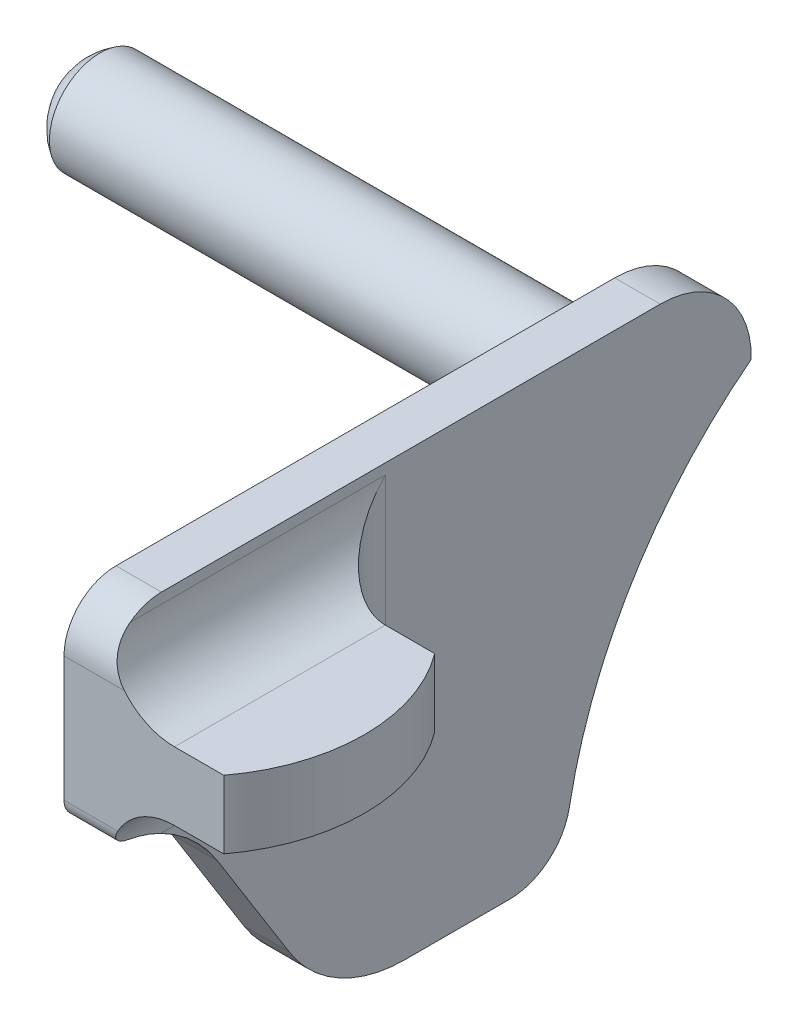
ISO-10303-21;
HEADER;
FILE_DESCRIPTION(('STEP AP214'),'2;1');
FILE_NAME('part.step','',(''),(''),'','','');
FILE_SCHEMA(('AUTOMOTIVE_DESIGN { 1 0 10303 214 1 1 1 1 }'));
ENDSEC;
DATA;
#1=APPLICATION_CONTEXT('core data for automotive mechanical design processes');
#2=APPLICATION_PROTOCOL_DEFINITION('international standard','automotive_design',2000,#1);
#3=PRODUCT_CONTEXT('',#1,'mechanical');
#4=PRODUCT('Part','Part','',(#3));
#5=PRODUCT_RELATED_PRODUCT_CATEGORY('part','',(#4));
#6=PRODUCT_DEFINITION_FORMATION('','',#4);
#7=PRODUCT_DEFINITION_CONTEXT('part definition',#1,'design');
#8=PRODUCT_DEFINITION('design','',#6,#7);
#9=PRODUCT_DEFINITION_SHAPE('','',#8);
#10=(LENGTH_UNIT() NAMED_UNIT(*) SI_UNIT(.MILLI.,.METRE.));
#11=(NAMED_UNIT(*) PLANE_ANGLE_UNIT() SI_UNIT($,.RADIAN.));
#12=(NAMED_UNIT(*) SI_UNIT($,.STERADIAN.) SOLID_ANGLE_UNIT());
#13=UNCERTAINTY_MEASURE_WITH_UNIT(LENGTH_MEASURE(1.E-05),#10,'distance_accuracy_value','');
#14=(GEOMETRIC_REPRESENTATION_CONTEXT(3) GLOBAL_UNCERTAINTY_ASSIGNED_CONTEXT((#13)) GLOBAL_UNIT_ASSIGNED_CONTEXT((#10,
#11,#12)) REPRESENTATION_CONTEXT('',''));
#15=CARTESIAN_POINT('',(0.,0.,0.));
#16=DIRECTION('',(0.,0.,1.));
#17=DIRECTION('',(1.,0.,0.));
#18=AXIS2_PLACEMENT_3D('',#15,#16,#17);
#19=CARTESIAN_POINT('',(-7.7978,0.,0.));
#20=DIRECTION('',(1.,0.,0.));
#21=DIRECTION('',(0.,0.,-1.));
#22=AXIS2_PLACEMENT_3D('',#19,#20,#21);
#23=CYLINDRICAL_SURFACE('',#22,3.0988);
#24=CARTESIAN_POINT('',(-1.7526,0.,0.));
#25=DIRECTION('',(-1.,0.,0.));
#26=DIRECTION('',(0.,0.,1.));
#27=AXIS2_PLACEMENT_3D('',#24,#25,#26);
#28=CIRCLE('',#27,3.0988);
#29=CARTESIAN_POINT('',(-1.7526,1.34318191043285,2.79256580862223));
#30=VERTEX_POINT('',#29);
#31=CARTESIAN_POINT('',(-1.7526,1.59787328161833,2.65506354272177));
#32=VERTEX_POINT('',#31);
#33=EDGE_CURVE('E344',#30,#32,#28,.T.);
#34=ORIENTED_EDGE('',*,*,#33,.T.);
#35=DIRECTION('',(1.,0.,0.));
#36=VECTOR('',#35,1.);
#37=CARTESIAN_POINT('',(-3.556,1.59787328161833,2.65506354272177));
#38=LINE('',#37,#36);
#39=CARTESIAN_POINT('',(-3.556,1.59787328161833,2.65506354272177));
#40=VERTEX_POINT('',#39);
#41=EDGE_CURVE('E55',#40,#32,#38,.T.);
#42=ORIENTED_EDGE('',*,*,#41,.F.);
#43=CARTESIAN_POINT('',(-3.556,0.,0.));
#44=DIRECTION('',(-1.,0.,0.));
#45=DIRECTION('',(0.,0.,1.));
#46=AXIS2_PLACEMENT_3D('',#43,#44,#45);
#47=CIRCLE('',#46,3.0988);
#48=CARTESIAN_POINT('',(-3.556,-0.998428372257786,-2.93354771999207));
#49=VERTEX_POINT('',#48);
#50=EDGE_CURVE('E245',#40,#49,#47,.T.);
#51=ORIENTED_EDGE('',*,*,#50,.T.);
#52=DIRECTION('',(1.,0.,0.));
#53=VECTOR('',#52,1.);
#54=CARTESIAN_POINT('',(-7.7978,-0.998428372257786,-2.93354771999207));
#55=LINE('',#54,#53);
#56=CARTESIAN_POINT('',(-7.7978,-0.998428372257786,-2.93354771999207));
#57=VERTEX_POINT('',#56);
#58=EDGE_CURVE('E588',#57,#49,#55,.T.);
#59=ORIENTED_EDGE('',*,*,#58,.F.);
#60=CARTESIAN_POINT('',(-7.7978,0.,0.));
#61=DIRECTION('',(1.,0.,0.));
#62=DIRECTION('',(0.,0.,-1.));
#63=AXIS2_PLACEMENT_3D('',#60,#61,#62);
#64=CIRCLE('',#63,3.0988);
#65=CARTESIAN_POINT('',(-7.7978,2.92440071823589,-1.0249106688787));
#66=VERTEX_POINT('',#65);
#67=EDGE_CURVE('E420',#57,#66,#64,.T.);
#68=ORIENTED_EDGE('',*,*,#67,.T.);
#69=DIRECTION('',(1.,0.,0.));
#70=VECTOR('',#69,1.);
#71=CARTESIAN_POINT('',(-7.7978,2.92440071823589,-1.0249106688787));
#72=LINE('',#71,#70);
#73=CARTESIAN_POINT('',(-6.096,2.92440071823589,-1.0249106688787));
#74=VERTEX_POINT('',#73);
#75=EDGE_CURVE('E363',#66,#74,#72,.T.);
#76=ORIENTED_EDGE('',*,*,#75,.T.);
#77=CARTESIAN_POINT('',(-6.096,2.92440071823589,-1.02491066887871));
#78=CARTESIAN_POINT('',(-6.02899324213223,2.92438554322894,-1.02490760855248));
#79=CARTESIAN_POINT('',(-5.96198742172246,2.92530658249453,-1.02232467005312));
#80=CARTESIAN_POINT('',(-5.82841608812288,2.92891045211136,-1.01197832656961));
#81=CARTESIAN_POINT('',(-5.76185063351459,2.93159351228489,-1.00421424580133));
#82=CARTESIAN_POINT('',(-5.6294924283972,2.93861729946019,-0.98346549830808));
#83=CARTESIAN_POINT('',(-5.56370135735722,2.94296111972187,-0.970471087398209));
#84=CARTESIAN_POINT('',(-5.43350701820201,2.95307315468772,-0.939247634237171));
#85=CARTESIAN_POINT('',(-5.36910368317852,2.95884130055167,-0.921018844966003));
#86=CARTESIAN_POINT('',(-5.17844755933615,2.97787430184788,-0.85835495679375));
#87=CARTESIAN_POINT('',(-5.05485957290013,2.9928610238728,-0.805959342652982));
#88=CARTESIAN_POINT('',(-4.81914077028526,3.02387398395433,-0.680360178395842));
#89=CARTESIAN_POINT('',(-4.70699354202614,3.0398986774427,-0.607187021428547));
#90=CARTESIAN_POINT('',(-4.50107634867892,3.06784715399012,-0.444334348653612));
#91=CARTESIAN_POINT('',(-4.40680631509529,3.07989321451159,-0.355310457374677));
#92=CARTESIAN_POINT('',(-4.23436239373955,3.0960602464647,-0.162226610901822));
#93=CARTESIAN_POINT('',(-4.1561866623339,3.1001821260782,-0.0581683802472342));
#94=CARTESIAN_POINT('',(-4.02014296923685,3.09666479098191,0.15493816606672));
#95=CARTESIAN_POINT('',(-3.96145448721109,3.08960384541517,0.263476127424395));
#96=CARTESIAN_POINT('',(-3.85837858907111,3.06256048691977,0.485603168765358));
#97=CARTESIAN_POINT('',(-3.81399643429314,3.04257332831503,0.599194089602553));
#98=CARTESIAN_POINT('',(-3.73586944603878,2.98729304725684,0.832934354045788));
#99=CARTESIAN_POINT('',(-3.70276880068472,2.95128338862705,0.953127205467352));
#100=CARTESIAN_POINT('',(-3.64799653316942,2.86382197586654,1.19042017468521));
#101=CARTESIAN_POINT('',(-3.62632757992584,2.81236662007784,1.30751956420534));
#102=CARTESIAN_POINT('',(-3.59151907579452,2.69191863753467,1.54083541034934));
#103=CARTESIAN_POINT('',(-3.5788289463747,2.62221461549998,1.65675093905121));
#104=CARTESIAN_POINT('',(-3.56208459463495,2.46787496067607,1.87895746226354));
#105=CARTESIAN_POINT('',(-3.55803746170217,2.3832271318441,1.98524048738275));
#106=CARTESIAN_POINT('',(-3.55802752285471,2.18809949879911,2.19968110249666));
#107=CARTESIAN_POINT('',(-3.56325918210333,2.07566644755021,2.30606808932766));
#108=CARTESIAN_POINT('',(-3.58510765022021,1.83696004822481,2.50034428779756));
#109=CARTESIAN_POINT('',(-3.60170439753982,1.71071141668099,2.5882657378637));
#110=CARTESIAN_POINT('',(-3.63223536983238,1.54108925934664,2.68880084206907));
#111=CARTESIAN_POINT('',(-3.63981538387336,1.50195630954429,2.71084885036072));
#112=CARTESIAN_POINT('',(-3.6562859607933,1.42304025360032,2.75309120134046));
#113=CARTESIAN_POINT('',(-3.66517480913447,1.38325805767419,2.77328791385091));
#114=CARTESIAN_POINT('',(-3.67477345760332,1.34318191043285,2.79256580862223));
#115=B_SPLINE_CURVE_WITH_KNOTS('',3,(#77,#78,#79,#80,#81,#82,#83,#84,#85,#86,#87,#88,#89,#90,
#91,#92,#93,#94,#95,#96,#97,#98,#99,#100,#101,#102,#103,#104,#105,#106,#107,#108,#109,#110,#111,
#112,#113,#114),.UNSPECIFIED.,.F.,.F.,(4,2,2,2,2,2,2,2,2,2,2,2,2,2,2,2,2,2,4),(0.,
0.200961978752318,0.401950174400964,0.603314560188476,0.804669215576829,1.20771156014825,
1.6101673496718,1.99875595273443,2.38730001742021,2.7563991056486,3.12563378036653,
3.51336365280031,3.90118400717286,4.30725661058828,4.71366216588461,5.17622917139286,
5.63798175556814,5.77459333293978,5.91102751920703),.UNSPECIFIED.);
#116=CARTESIAN_POINT('',(-3.67477345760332,1.34318191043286,2.79256580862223));
#117=VERTEX_POINT('',#116);
#118=EDGE_CURVE('E357',#74,#117,#115,.T.);
#119=ORIENTED_EDGE('',*,*,#118,.T.);
#120=DIRECTION('',(1.,0.,0.));
#121=VECTOR('',#120,1.);
#122=CARTESIAN_POINT('',(-7.7978,1.34318191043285,2.79256580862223));
#123=LINE('',#122,#121);
#124=EDGE_CURVE('E415',#117,#30,#123,.T.);
#125=ORIENTED_EDGE('',*,*,#124,.T.);
#126=EDGE_LOOP('',(#34,#42,#51,#59,#68,#76,#119,#125));
#127=FACE_BOUND('',#126,.T.);
#128=ADVANCED_FACE('F36',(#127),#23,.T.);
#129=CARTESIAN_POINT('',(0.,8.0510411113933,-25.9024371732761));
#130=DIRECTION('',(1.,0.,0.));
#131=DIRECTION('',(0.,0.,-1.));
#132=AXIS2_PLACEMENT_3D('',#129,#130,#131);
#133=PLANE('',#132);
#134=CARTESIAN_POINT('',(0.,9.28041994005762,-8.82711695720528));
#135=DIRECTION('',(1.,0.,0.));
#136=DIRECTION('',(0.,0.,-1.));
#137=AXIS2_PLACEMENT_3D('',#134,#135,#136);
#138=CIRCLE('',#137,1.97866);
#139=CARTESIAN_POINT('',(0.,9.28041994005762,-10.8057769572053));
#140=VERTEX_POINT('',#139);
#141=EDGE_CURVE('E364',#140,#140,#138,.F.);
#142=ORIENTED_EDGE('',*,*,#141,.F.);
#143=EDGE_LOOP('',(#142));
#144=FACE_BOUND('',#143,.T.);
#145=CARTESIAN_POINT('',(0.,-5.34047338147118,-24.3052834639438));
#146=DIRECTION('',(1.,0.,0.));
#147=DIRECTION('',(0.,0.,-1.));
#148=AXIS2_PLACEMENT_3D('',#145,#146,#147);
#149=CIRCLE('',#148,19.05);
#150=CARTESIAN_POINT('',(0.,9.75331983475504,-12.6828953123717));
#151=VERTEX_POINT('',#150);
#152=CARTESIAN_POINT('',(0.,-1.84862005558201,-5.57804500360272));
#153=VERTEX_POINT('',#152);
#154=EDGE_CURVE('E523',#151,#153,#149,.T.);
#155=ORIENTED_EDGE('',*,*,#154,.T.);
#156=CARTESIAN_POINT('',(0.,-1.41097443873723,-3.23089778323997));
#157=DIRECTION('',(1.,0.,0.));
#158=DIRECTION('',(0.,0.,-1.));
#159=AXIS2_PLACEMENT_3D('',#156,#157,#158);
#160=CIRCLE('',#159,2.3876);
#161=CARTESIAN_POINT('',(0.,-3.79857443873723,-3.23089778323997));
#162=VERTEX_POINT('',#161);
#163=EDGE_CURVE('E623',#153,#162,#160,.F.);
#164=ORIENTED_EDGE('',*,*,#163,.T.);
#165=DIRECTION('',(0.,0.,-1.));
#166=VECTOR('',#165,1.);
#167=CARTESIAN_POINT('',(0.,-3.79857443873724,-25.9024371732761));
#168=LINE('',#167,#166);
#169=CARTESIAN_POINT('',(0.,-3.79857443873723,0.837462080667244));
#170=VERTEX_POINT('',#169);
#171=EDGE_CURVE('E598',#170,#162,#168,.T.);
#172=ORIENTED_EDGE('',*,*,#171,.F.);
#173=CARTESIAN_POINT('',(0.,1.53542556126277,0.837462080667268));
#174=DIRECTION('',(1.,0.,0.));
#175=DIRECTION('',(0.,0.,-1.));
#176=AXIS2_PLACEMENT_3D('',#173,#174,#175);
#177=CIRCLE('',#176,5.334);
#178=CARTESIAN_POINT('',(0.,-1.29116379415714,5.36095062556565));
#179=VERTEX_POINT('',#178);
#180=EDGE_CURVE('E544',#170,#179,#177,.F.);
#181=ORIENTED_EDGE('',*,*,#180,.T.);
#182=DIRECTION('',(0.,-0.848048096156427,-0.529919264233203));
#183=VECTOR('',#182,1.);
#184=CARTESIAN_POINT('',(0.,-8.62205821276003,0.780099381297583));
#185=LINE('',#184,#183);
#186=CARTESIAN_POINT('',(0.,3.22967708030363,8.18588553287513));
#187=VERTEX_POINT('',#186);
#188=EDGE_CURVE('E541',#187,#179,#185,.T.);
#189=ORIENTED_EDGE('',*,*,#188,.F.);
#190=CARTESIAN_POINT('',(0.,0.26848823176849,12.9247782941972));
#191=DIRECTION('',(1.,0.,0.));
#192=DIRECTION('',(0.,0.,-1.));
#193=AXIS2_PLACEMENT_3D('',#190,#191,#192);
#194=CIRCLE('',#193,5.588);
#195=CARTESIAN_POINT('',(0.,5.73962102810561,11.7879186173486));
#196=VERTEX_POINT('',#195);
#197=EDGE_CURVE('E538',#187,#196,#194,.T.);
#198=ORIENTED_EDGE('',*,*,#197,.T.);
#199=CARTESIAN_POINT('',(0.,6.48568459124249,11.6328922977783));
#200=DIRECTION('',(1.,0.,0.));
#201=DIRECTION('',(0.,0.,-1.));
#202=AXIS2_PLACEMENT_3D('',#199,#200,#201);
#203=CIRCLE('',#202,0.762);
#204=CARTESIAN_POINT('',(0.,6.48568459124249,12.3948922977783));
#205=VERTEX_POINT('',#204);
#206=EDGE_CURVE('E535',#205,#196,#203,.T.);
#207=ORIENTED_EDGE('',*,*,#206,.F.);
#208=DIRECTION('',(0.,-1.,0.));
#209=VECTOR('',#208,1.);
#210=CARTESIAN_POINT('',(0.,8.0510411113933,12.3948922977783));
#211=LINE('',#210,#209);
#212=CARTESIAN_POINT('',(0.,11.3700911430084,12.3948922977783));
#213=VERTEX_POINT('',#212);
#214=EDGE_CURVE('E530',#213,#205,#211,.T.);
#215=ORIENTED_EDGE('',*,*,#214,.F.);
#216=CARTESIAN_POINT('',(0.,11.3700911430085,10.3628922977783));
#217=DIRECTION('',(1.,0.,0.));
#218=DIRECTION('',(0.,0.,-1.));
#219=AXIS2_PLACEMENT_3D('',#216,#217,#218);
#220=CIRCLE('',#219,2.032);
#221=CARTESIAN_POINT('',(0.,13.4020911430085,10.3628922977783));
#222=VERTEX_POINT('',#221);
#223=EDGE_CURVE('E528',#222,#213,#220,.T.);
#224=ORIENTED_EDGE('',*,*,#223,.F.);
#225=DIRECTION('',(0.,0.,-1.));
#226=VECTOR('',#225,1.);
#227=CARTESIAN_POINT('',(0.,13.4020911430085,-25.9024371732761));
#228=LINE('',#227,#226);
#229=CARTESIAN_POINT('',(0.,13.4020911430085,-9.12810565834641));
#230=VERTEX_POINT('',#229);
#231=EDGE_CURVE('E522',#222,#230,#228,.T.);
#232=ORIENTED_EDGE('',*,*,#231,.T.);
#233=CARTESIAN_POINT('',(0.,9.84609114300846,-9.12810565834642));
#234=DIRECTION('',(1.,0.,0.));
#235=DIRECTION('',(0.,0.,-1.));
#236=AXIS2_PLACEMENT_3D('',#233,#234,#235);
#237=CIRCLE('',#236,3.556);
#238=EDGE_CURVE('E514',#230,#151,#237,.F.);
#239=ORIENTED_EDGE('',*,*,#238,.T.);
#240=EDGE_LOOP('',(#155,#164,#172,#181,#189,#198,#207,#215,#224,#232,#239));
#241=FACE_BOUND('',#240,.T.);
#242=DIRECTION('',(0.,0.515642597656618,0.856803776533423));
#243=VECTOR('',#242,1.);
#244=CARTESIAN_POINT('',(0.,-5.01595596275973,-8.33462951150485));
#245=LINE('',#244,#243);
#246=CARTESIAN_POINT('',(0.,1.59787328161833,2.65506354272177));
#247=VERTEX_POINT('',#246);
#248=CARTESIAN_POINT('',(0.,1.67490900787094,2.78306790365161));
#249=VERTEX_POINT('',#248);
#250=EDGE_CURVE('E252',#247,#249,#245,.T.);
#251=ORIENTED_EDGE('',*,*,#250,.F.);
#252=DIRECTION('',(0.,-0.642787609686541,-0.766044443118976));
#253=VECTOR('',#252,1.);
#254=CARTESIAN_POINT('',(0.,1.59787328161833,2.65506354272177));
#255=LINE('',#254,#253);
#256=CARTESIAN_POINT('',(0.,-2.01229792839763,-1.64737096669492));
#257=VERTEX_POINT('',#256);
#258=EDGE_CURVE('E343',#247,#257,#255,.T.);
#259=ORIENTED_EDGE('',*,*,#258,.T.);
#260=CARTESIAN_POINT('',(0.,-6.81249396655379,-6.47397327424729));
#261=DIRECTION('',(1.,0.,0.));
#262=DIRECTION('',(0.,0.,-1.));
#263=AXIS2_PLACEMENT_3D('',#260,#261,#262);
#264=CIRCLE('',#263,6.8072);
#265=CARTESIAN_POINT('',(0.,-0.998428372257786,-2.93354771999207));
#266=VERTEX_POINT('',#265);
#267=EDGE_CURVE('E595',#257,#266,#264,.F.);
#268=ORIENTED_EDGE('',*,*,#267,.T.);
#269=DIRECTION('',(0.,0.,-1.));
#270=VECTOR('',#269,1.);
#271=CARTESIAN_POINT('',(0.,-0.998428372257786,-1.47109235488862));
#272=LINE('',#271,#270);
#273=CARTESIAN_POINT('',(0.,-0.998428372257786,-3.09094288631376));
#274=VERTEX_POINT('',#273);
#275=EDGE_CURVE('E265',#266,#274,#272,.T.);
#276=ORIENTED_EDGE('',*,*,#275,.T.);
#277=CARTESIAN_POINT('',(0.,0.,0.));
#278=DIRECTION('',(1.,0.,0.));
#279=DIRECTION('',(0.,0.,-1.));
#280=AXIS2_PLACEMENT_3D('',#277,#278,#279);
#281=CIRCLE('',#280,3.24819752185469);
#282=EDGE_CURVE('E63',#274,#249,#281,.T.);
#283=ORIENTED_EDGE('',*,*,#282,.T.);
#284=EDGE_LOOP('',(#251,#259,#268,#276,#283));
#285=FACE_BOUND('',#284,.T.);
#286=ADVANCED_FACE('F354',(#144,#241,#285),#133,.F.);
#287=CARTESIAN_POINT('',(-7.7978,-0.150937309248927,4.699));
#288=DIRECTION('',(1.,0.,0.));
#289=DIRECTION('',(0.,0.,-1.));
#290=AXIS2_PLACEMENT_3D('',#287,#288,#289);
#291=PLANE('',#290);
#292=DIRECTION('',(0.,-0.642787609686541,-0.766044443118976));
#293=VECTOR('',#292,1.);
#294=CARTESIAN_POINT('',(-7.7978,1.04507536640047,3.69542620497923));
#295=LINE('',#294,#293);
#296=CARTESIAN_POINT('',(-7.7978,-0.113932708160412,2.31417416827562));
#297=VERTEX_POINT('',#296);
#298=CARTESIAN_POINT('',(-7.7978,-2.84601420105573,-0.941793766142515));
#299=VERTEX_POINT('',#298);
#300=EDGE_CURVE('E573',#297,#299,#295,.T.);
#301=ORIENTED_EDGE('',*,*,#300,.F.);
#302=DIRECTION('',(0.,-0.673012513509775,0.739631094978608));
#303=VECTOR('',#302,1.);
#304=CARTESIAN_POINT('',(-7.7978,-1.31781473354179,3.63722323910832));
#305=LINE('',#304,#303);
#306=EDGE_CURVE('E389',#66,#297,#305,.T.);
#307=ORIENTED_EDGE('',*,*,#306,.F.);
#308=ORIENTED_EDGE('',*,*,#67,.F.);
#309=CARTESIAN_POINT('',(-7.7978,-6.81249396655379,-6.47397327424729));
#310=DIRECTION('',(-1.,0.,0.));
#311=DIRECTION('',(0.,0.,-1.));
#312=AXIS2_PLACEMENT_3D('',#309,#310,#311);
#313=CIRCLE('',#312,6.8072);
#314=EDGE_CURVE('E942',#299,#57,#313,.T.);
#315=ORIENTED_EDGE('',*,*,#314,.F.);
#316=EDGE_LOOP('',(#301,#307,#308,#315));
#317=FACE_BOUND('',#316,.T.);
#318=ADVANCED_FACE('F349',(#317),#291,.F.);
#319=CARTESIAN_POINT('',(-7.7978,-6.81249396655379,-6.47397327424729));
#320=DIRECTION('',(1.,0.,0.));
#321=DIRECTION('',(0.,0.,-1.));
#322=AXIS2_PLACEMENT_3D('',#319,#320,#321);
#323=CYLINDRICAL_SURFACE('',#322,6.8072);
#324=CARTESIAN_POINT('',(-4.82271465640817,-2.98058563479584,-0.847744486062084));
#325=CARTESIAN_POINT('',(-4.88186210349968,-2.96409952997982,-0.858975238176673));
#326=CARTESIAN_POINT('',(-4.9416204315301,-2.94920237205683,-0.869224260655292));
#327=CARTESIAN_POINT('',(-5.06184179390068,-2.92255573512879,-0.88768504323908));
#328=CARTESIAN_POINT('',(-5.12230013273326,-2.9107916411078,-0.895906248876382));
#329=CARTESIAN_POINT('',(-5.29093829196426,-2.88228740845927,-0.91591840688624));
#330=CARTESIAN_POINT('',(-5.39992487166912,-2.86871755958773,-0.925565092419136));
#331=CARTESIAN_POINT('',(-5.61995482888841,-2.85055866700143,-0.938537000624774));
#332=CARTESIAN_POINT('',(-5.73100780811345,-2.84604663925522,-0.941808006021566));
#333=CARTESIAN_POINT('',(-5.842,-2.84601420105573,-0.941793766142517));
#334=B_SPLINE_CURVE_WITH_KNOTS('',3,(#324,#325,#326,#327,#328,#329,#330,#331,#332,#333),
.UNSPECIFIED.,.F.,.F.,(4,2,2,2,4),(0.,0.187200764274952,0.373512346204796,0.703664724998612,
1.03661259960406),.UNSPECIFIED.);
#335=CARTESIAN_POINT('',(-4.82271465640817,-2.98058563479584,-0.847744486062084));
#336=VERTEX_POINT('',#335);
#337=CARTESIAN_POINT('',(-5.842,-2.84601420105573,-0.941793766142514));
#338=VERTEX_POINT('',#337);
#339=EDGE_CURVE('E335',#336,#338,#334,.T.);
#340=ORIENTED_EDGE('',*,*,#339,.T.);
#341=DIRECTION('',(1.,0.,0.));
#342=VECTOR('',#341,1.);
#343=CARTESIAN_POINT('',(-7.7978,-2.84601420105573,-0.941793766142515));
#344=LINE('',#343,#342);
#345=EDGE_CURVE('E336',#338,#299,#344,.F.);
#346=ORIENTED_EDGE('',*,*,#345,.T.);
#347=ORIENTED_EDGE('',*,*,#314,.T.);
#348=ORIENTED_EDGE('',*,*,#58,.T.);
#349=DIRECTION('',(1.,0.,0.));
#350=VECTOR('',#349,1.);
#351=CARTESIAN_POINT('',(-3.556,-0.998428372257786,-2.93354771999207));
#352=LINE('',#351,#350);
#353=EDGE_CURVE('E260',#49,#266,#352,.T.);
#354=ORIENTED_EDGE('',*,*,#353,.T.);
#355=ORIENTED_EDGE('',*,*,#267,.F.);
#356=DIRECTION('',(1.,0.,0.));
#357=VECTOR('',#356,1.);
#358=CARTESIAN_POINT('',(-1.7526,-2.01229792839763,-1.64737096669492));
#359=LINE('',#358,#357);
#360=CARTESIAN_POINT('',(-1.7526,-2.01229792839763,-1.64737096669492));
#361=VERTEX_POINT('',#360);
#362=EDGE_CURVE('E949',#361,#257,#359,.T.);
#363=ORIENTED_EDGE('',*,*,#362,.F.);
#364=CARTESIAN_POINT('',(-1.7526,-6.81249396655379,-6.47397327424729));
#365=DIRECTION('',(1.,0.,0.));
#366=DIRECTION('',(0.,0.,1.));
#367=AXIS2_PLACEMENT_3D('',#364,#365,#366);
#368=CIRCLE('',#367,6.8072);
#369=CARTESIAN_POINT('',(-1.7526,-2.98058563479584,-0.847744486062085));
#370=VERTEX_POINT('',#369);
#371=EDGE_CURVE('E587',#361,#370,#368,.T.);
#372=ORIENTED_EDGE('',*,*,#371,.T.);
#373=DIRECTION('',(1.,0.,0.));
#374=VECTOR('',#373,1.);
#375=CARTESIAN_POINT('',(-7.7978,-2.98058563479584,-0.847744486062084));
#376=LINE('',#375,#374);
#377=EDGE_CURVE('E581',#336,#370,#376,.T.);
#378=ORIENTED_EDGE('',*,*,#377,.F.);
#379=EDGE_LOOP('',(#340,#346,#347,#348,#354,#355,#363,#372,#378));
#380=FACE_BOUND('',#379,.T.);
#381=ADVANCED_FACE('F322',(#380),#323,.F.);
#382=CARTESIAN_POINT('',(-7.7978,-0.301874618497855,9.398));
#383=DIRECTION('',(1.,0.,0.));
#384=DIRECTION('',(0.,0.,-1.));
#385=AXIS2_PLACEMENT_3D('',#382,#383,#384);
#386=CYLINDRICAL_SURFACE('',#385,6.8072);
#387=CARTESIAN_POINT('',(-6.096,-0.365916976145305,2.5911012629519));
#388=CARTESIAN_POINT('',(-6.02925743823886,-0.36594913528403,2.59111090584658));
#389=CARTESIAN_POINT('',(-5.96253378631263,-0.362656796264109,2.59107073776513));
#390=CARTESIAN_POINT('',(-5.82978600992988,-0.349672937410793,2.59096225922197));
#391=CARTESIAN_POINT('',(-5.76376117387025,-0.339988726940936,2.59089398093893));
#392=CARTESIAN_POINT('',(-5.63360849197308,-0.314604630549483,2.59080095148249));
#393=CARTESIAN_POINT('',(-5.569467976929,-0.298969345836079,2.59077574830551));
#394=CARTESIAN_POINT('',(-5.44282489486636,-0.262095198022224,2.5908911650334));
#395=CARTESIAN_POINT('',(-5.38032271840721,-0.240855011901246,2.59103182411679));
#396=CARTESIAN_POINT('',(-5.19640746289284,-0.169643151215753,2.59191938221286));
#397=CARTESIAN_POINT('',(-5.07789087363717,-0.112036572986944,2.59312839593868));
#398=CARTESIAN_POINT('',(-4.8502287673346,0.0197952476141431,2.59808395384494));
#399=CARTESIAN_POINT('',(-4.74111962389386,0.0940813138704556,2.60183988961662));
#400=CARTESIAN_POINT('',(-4.49147345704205,0.288294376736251,2.61548266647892));
#401=CARTESIAN_POINT('',(-4.35595598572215,0.414558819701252,2.62722832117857));
#402=CARTESIAN_POINT('',(-4.10670435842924,0.685479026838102,2.66140343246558));
#403=CARTESIAN_POINT('',(-3.99295483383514,0.830121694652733,2.68382531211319));
#404=CARTESIAN_POINT('',(-3.85122209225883,1.03980197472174,2.7240605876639));
#405=CARTESIAN_POINT('',(-3.81334039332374,1.0994078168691,2.73630225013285));
#406=CARTESIAN_POINT('',(-3.74128591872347,1.22016304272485,2.76285274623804));
#407=CARTESIAN_POINT('',(-3.7071040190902,1.28130814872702,2.77715628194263));
#408=CARTESIAN_POINT('',(-3.67477345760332,1.34318191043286,2.79256580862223));
#409=B_SPLINE_CURVE_WITH_KNOTS('',3,(#387,#388,#389,#390,#391,#392,#393,#394,#395,#396,#397,
#398,#399,#400,#401,#402,#403,#404,#405,#406,#407,#408),.UNSPECIFIED.,.F.,.F.,(4,2,2,2,2,2,2,2,
2,2,4),(0.,0.200115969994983,0.40000349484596,0.597780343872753,0.795603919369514,
1.18915042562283,1.58415605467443,2.13810179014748,2.69165497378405,2.90657557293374,
3.12095346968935),.UNSPECIFIED.);
#410=CARTESIAN_POINT('',(-4.95146379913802,-0.0387785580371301,2.5958861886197));
#411=VERTEX_POINT('',#410);
#412=EDGE_CURVE('E307',#411,#117,#409,.T.);
#413=ORIENTED_EDGE('',*,*,#412,.F.);
#414=CARTESIAN_POINT('',(-5.842,0.129673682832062,2.6044929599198));
#415=CARTESIAN_POINT('',(-5.77873203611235,0.129685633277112,2.60449946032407));
#416=CARTESIAN_POINT('',(-5.71546888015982,0.127177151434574,2.60433452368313));
#417=CARTESIAN_POINT('',(-5.58933679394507,0.117207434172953,2.60370917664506));
#418=CARTESIAN_POINT('',(-5.52646785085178,0.109746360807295,2.6032487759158));
#419=CARTESIAN_POINT('',(-5.40177304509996,0.0900020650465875,2.60208240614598));
#420=CARTESIAN_POINT('',(-5.33994386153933,0.0777396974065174,2.60137750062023));
#421=CARTESIAN_POINT('',(-5.21741717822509,0.0485563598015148,2.59981020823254));
#422=CARTESIAN_POINT('',(-5.15671940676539,0.0316365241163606,2.59894785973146));
#423=CARTESIAN_POINT('',(-5.03215629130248,-0.00813767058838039,2.59710915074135));
#424=CARTESIAN_POINT('',(-4.96840406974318,-0.031347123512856,2.5961291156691));
#425=CARTESIAN_POINT('',(-4.84291995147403,-0.0826582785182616,2.59428238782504));
#426=CARTESIAN_POINT('',(-4.78118797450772,-0.110759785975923,2.59341569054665));
#427=CARTESIAN_POINT('',(-4.59952628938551,-0.201956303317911,2.59126109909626));
#428=CARTESIAN_POINT('',(-4.48299901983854,-0.271986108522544,2.590416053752));
#429=CARTESIAN_POINT('',(-4.26142827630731,-0.42825492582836,2.59152589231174));
#430=CARTESIAN_POINT('',(-4.15638369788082,-0.514492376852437,2.59348050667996));
#431=CARTESIAN_POINT('',(-4.00913388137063,-0.654466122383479,2.59977705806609));
#432=CARTESIAN_POINT('',(-3.96174987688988,-0.702919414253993,2.60243876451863));
#433=CARTESIAN_POINT('',(-3.87074848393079,-0.803143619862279,2.60909521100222));
#434=CARTESIAN_POINT('',(-3.82713059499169,-0.854914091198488,2.61308977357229));
#435=CARTESIAN_POINT('',(-3.71293314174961,-1.00143674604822,2.62619796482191));
#436=CARTESIAN_POINT('',(-3.64655082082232,-1.09940928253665,2.63690656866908));
#437=CARTESIAN_POINT('',(-3.52862485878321,-1.30372698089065,2.66412789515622));
#438=CARTESIAN_POINT('',(-3.47715086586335,-1.41010857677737,2.680667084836));
#439=CARTESIAN_POINT('',(-3.43463111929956,-1.51962903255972,2.70060901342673));
#440=B_SPLINE_CURVE_WITH_KNOTS('',3,(#414,#415,#416,#417,#418,#419,#420,#421,#422,#423,#424,
#425,#426,#427,#428,#429,#430,#431,#432,#433,#434,#435,#436,#437,#438,#439),.UNSPECIFIED.,.F.,
.F.,(4,2,2,2,2,2,2,2,2,2,2,2,4),(0.,0.189746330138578,0.379486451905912,0.568411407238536,
0.757290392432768,0.960625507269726,1.16395253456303,1.57019517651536,1.9763987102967,
2.1796955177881,2.38296526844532,2.73806922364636,3.09480632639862),.UNSPECIFIED.);
#441=CARTESIAN_POINT('',(-3.43463111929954,-1.5196290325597,2.70060901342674));
#442=VERTEX_POINT('',#441);
#443=EDGE_CURVE('E329',#411,#442,#440,.T.);
#444=ORIENTED_EDGE('',*,*,#443,.T.);
#445=DIRECTION('',(1.,0.,0.));
#446=VECTOR('',#445,1.);
#447=CARTESIAN_POINT('',(-7.7978,-1.51962903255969,2.70060901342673));
#448=LINE('',#447,#446);
#449=CARTESIAN_POINT('',(-1.7526,-1.51962903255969,2.70060901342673));
#450=VERTEX_POINT('',#449);
#451=EDGE_CURVE('E412',#442,#450,#448,.T.);
#452=ORIENTED_EDGE('',*,*,#451,.T.);
#453=CARTESIAN_POINT('',(-1.7526,-0.301874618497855,9.398));
#454=DIRECTION('',(1.,0.,0.));
#455=DIRECTION('',(0.,0.,1.));
#456=AXIS2_PLACEMENT_3D('',#453,#454,#455);
#457=CIRCLE('',#456,6.8072);
#458=EDGE_CURVE('E952',#450,#30,#457,.T.);
#459=ORIENTED_EDGE('',*,*,#458,.T.);
#460=ORIENTED_EDGE('',*,*,#124,.F.);
#461=EDGE_LOOP('',(#413,#444,#452,#459,#460));
#462=FACE_BOUND('',#461,.T.);
#463=ADVANCED_FACE('F316',(#462),#386,.F.);
#464=CARTESIAN_POINT('',(-7.7978,0.,0.));
#465=DIRECTION('',(1.,0.,0.));
#466=DIRECTION('',(0.,0.,-1.));
#467=AXIS2_PLACEMENT_3D('',#464,#465,#466);
#468=CYLINDRICAL_SURFACE('',#467,3.0988);
#469=ORIENTED_EDGE('',*,*,#451,.F.);
#470=CARTESIAN_POINT('',(-3.43463111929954,-1.5196290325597,2.70060901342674));
#471=CARTESIAN_POINT('',(-3.42258560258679,-1.5876480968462,2.66235415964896));
#472=CARTESIAN_POINT('',(-3.41253681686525,-1.65444468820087,2.62136671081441));
#473=CARTESIAN_POINT('',(-3.39571101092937,-1.78499024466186,2.53426449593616));
#474=CARTESIAN_POINT('',(-3.3889321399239,-1.84874091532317,2.48815264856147));
#475=CARTESIAN_POINT('',(-3.37791324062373,-1.97266156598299,2.39110229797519));
#476=CARTESIAN_POINT('',(-3.37367285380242,-2.03283205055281,2.34016447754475));
#477=CARTESIAN_POINT('',(-3.36725205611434,-2.14918131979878,2.2337845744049));
#478=CARTESIAN_POINT('',(-3.3650719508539,-2.20535951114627,2.17834182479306));
#479=CARTESIAN_POINT('',(-3.36248542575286,-2.31387290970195,2.06274113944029));
#480=CARTESIAN_POINT('',(-3.36209673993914,-2.3661646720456,2.00254203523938));
#481=CARTESIAN_POINT('',(-3.36309053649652,-2.46594767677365,1.87830014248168));
#482=CARTESIAN_POINT('',(-3.36447304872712,-2.51343883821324,1.81425728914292));
#483=CARTESIAN_POINT('',(-3.36918957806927,-2.60332995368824,1.68273039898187));
#484=CARTESIAN_POINT('',(-3.37252420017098,-2.64572832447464,1.61524530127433));
#485=CARTESIAN_POINT('',(-3.3815520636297,-2.72513961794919,1.47733021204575));
#486=CARTESIAN_POINT('',(-3.38724503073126,-2.76215316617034,1.40690056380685));
#487=CARTESIAN_POINT('',(-3.4006748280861,-2.82607969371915,1.27302605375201));
#488=CARTESIAN_POINT('',(-3.40804691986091,-2.85368057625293,1.20987254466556));
#489=CARTESIAN_POINT('',(-3.42557690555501,-2.90449822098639,1.08220570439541));
#490=CARTESIAN_POINT('',(-3.43573431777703,-2.92771574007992,1.01769261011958));
#491=CARTESIAN_POINT('',(-3.45943888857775,-2.96964817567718,0.887916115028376));
#492=CARTESIAN_POINT('',(-3.47298172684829,-2.9883687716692,0.822653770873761));
#493=CARTESIAN_POINT('',(-3.50413285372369,-3.02130583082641,0.691960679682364));
#494=CARTESIAN_POINT('',(-3.52174022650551,-3.03552330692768,0.626529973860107));
#495=CARTESIAN_POINT('',(-3.55788208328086,-3.05723602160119,0.508673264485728));
#496=CARTESIAN_POINT('',(-3.57560489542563,-3.06549521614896,0.456138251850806));
#497=CARTESIAN_POINT('',(-3.6144562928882,-3.07919384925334,0.351971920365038));
#498=CARTESIAN_POINT('',(-3.63558410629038,-3.08463392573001,0.30034039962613));
#499=CARTESIAN_POINT('',(-3.68145360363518,-3.09285205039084,0.198571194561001));
#500=CARTESIAN_POINT('',(-3.70619024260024,-3.09563377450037,0.148431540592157));
#501=CARTESIAN_POINT('',(-3.7594331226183,-3.09878519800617,0.0501115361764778));
#502=CARTESIAN_POINT('',(-3.7879393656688,-3.0991548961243,0.00193118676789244));
#503=CARTESIAN_POINT('',(-3.84880385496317,-3.09778964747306,-0.0920649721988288));
#504=CARTESIAN_POINT('',(-3.88117107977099,-3.09604970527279,-0.137874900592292));
#505=CARTESIAN_POINT('',(-3.94958625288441,-3.09082655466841,-0.226553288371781));
#506=CARTESIAN_POINT('',(-3.98563429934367,-3.08734329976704,-0.269421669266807));
#507=CARTESIAN_POINT('',(-4.06127560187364,-3.07902729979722,-0.351963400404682));
#508=CARTESIAN_POINT('',(-4.10087764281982,-3.07419114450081,-0.391628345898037));
#509=CARTESIAN_POINT('',(-4.183236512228,-3.06358666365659,-0.46739979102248));
#510=CARTESIAN_POINT('',(-4.22599361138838,-3.05781825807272,-0.503505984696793));
#511=CARTESIAN_POINT('',(-4.31210934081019,-3.04604377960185,-0.570326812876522));
#512=CARTESIAN_POINT('',(-4.35533363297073,-3.04006357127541,-0.601219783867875));
#513=CARTESIAN_POINT('',(-4.44398295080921,-3.02792496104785,-0.659637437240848));
#514=CARTESIAN_POINT('',(-4.48940830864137,-3.02176653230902,-0.687161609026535));
#515=CARTESIAN_POINT('',(-4.58194432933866,-3.00956956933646,-0.738752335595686));
#516=CARTESIAN_POINT('',(-4.62904737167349,-3.00353064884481,-0.762832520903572));
#517=CARTESIAN_POINT('',(-4.72479305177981,-2.99176832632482,-0.807720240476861));
#518=CARTESIAN_POINT('',(-4.77343474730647,-2.98604473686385,-0.828529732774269));
#519=CARTESIAN_POINT('',(-4.82271465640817,-2.98058563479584,-0.847744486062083));
#520=B_SPLINE_CURVE_WITH_KNOTS('',3,(#470,#471,#472,#473,#474,#475,#476,#477,#478,#479,#480,
#481,#482,#483,#484,#485,#486,#487,#488,#489,#490,#491,#492,#493,#494,#495,#496,#497,#498,#499,
#500,#501,#502,#503,#504,#505,#506,#507,#508,#509,#510,#511,#512,#513,#514,#515,#516,#517,#518,
#519),.UNSPECIFIED.,.F.,.F.,(4,2,2,2,2,2,2,2,2,2,2,2,2,2,2,2,2,2,2,2,2,2,2,2,4),(0.,
0.236759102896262,0.473384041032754,0.7099755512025,0.946602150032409,1.18556625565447,
1.42453438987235,1.66357662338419,1.90259106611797,2.11034226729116,2.31805756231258,
2.52550912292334,2.73291398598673,2.90091479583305,3.0688775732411,3.23660775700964,
3.40433802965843,3.57246624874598,3.74059895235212,3.90915934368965,4.07773421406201,
4.23797171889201,4.39823348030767,4.55784228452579,4.71735517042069),.UNSPECIFIED.);
#521=EDGE_CURVE('E409',#442,#336,#520,.T.);
#522=ORIENTED_EDGE('',*,*,#521,.T.);
#523=ORIENTED_EDGE('',*,*,#377,.T.);
#524=CARTESIAN_POINT('',(-1.7526,0.,0.));
#525=DIRECTION('',(-1.,0.,0.));
#526=DIRECTION('',(0.,0.,1.));
#527=AXIS2_PLACEMENT_3D('',#524,#525,#526);
#528=CIRCLE('',#527,3.0988);
#529=EDGE_CURVE('E955',#370,#450,#528,.T.);
#530=ORIENTED_EDGE('',*,*,#529,.T.);
#531=EDGE_LOOP('',(#469,#522,#523,#530));
#532=FACE_BOUND('',#531,.T.);
#533=ADVANCED_FACE('F321',(#532),#468,.T.);
#534=CARTESIAN_POINT('',(1.778,-3.79857443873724,-25.9024371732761));
#535=DIRECTION('',(0.,1.,0.));
#536=DIRECTION('',(0.,0.,1.));
#537=AXIS2_PLACEMENT_3D('',#534,#535,#536);
#538=PLANE('',#537);
#539=ORIENTED_EDGE('',*,*,#171,.T.);
#540=DIRECTION('',(-1.,0.,0.));
#541=VECTOR('',#540,1.);
#542=CARTESIAN_POINT('',(1.778,-3.79857443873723,-3.23089778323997));
#543=LINE('',#542,#541);
#544=CARTESIAN_POINT('',(1.778,-3.79857443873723,-3.23089778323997));
#545=VERTEX_POINT('',#544);
#546=EDGE_CURVE('E570',#545,#162,#543,.T.);
#547=ORIENTED_EDGE('',*,*,#546,.F.);
#548=DIRECTION('',(0.,0.,-1.));
#549=VECTOR('',#548,1.);
#550=CARTESIAN_POINT('',(1.778,-3.79857443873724,-25.9024371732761));
#551=LINE('',#550,#549);
#552=CARTESIAN_POINT('',(1.778,-3.79857443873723,0.837462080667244));
#553=VERTEX_POINT('',#552);
#554=EDGE_CURVE('E547',#553,#545,#551,.T.);
#555=ORIENTED_EDGE('',*,*,#554,.F.);
#556=DIRECTION('',(-1.,0.,0.));
#557=VECTOR('',#556,1.);
#558=CARTESIAN_POINT('',(1.778,-3.79857443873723,0.837462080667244));
#559=LINE('',#558,#557);
#560=EDGE_CURVE('E548',#553,#170,#559,.T.);
#561=ORIENTED_EDGE('',*,*,#560,.T.);
#562=EDGE_LOOP('',(#539,#547,#555,#561));
#563=FACE_BOUND('',#562,.T.);
#564=ADVANCED_FACE('F494',(#563),#538,.F.);
#565=CARTESIAN_POINT('',(1.778,-1.41097443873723,-3.23089778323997));
#566=DIRECTION('',(-1.,0.,0.));
#567=DIRECTION('',(0.,0.,1.));
#568=AXIS2_PLACEMENT_3D('',#565,#566,#567);
#569=CYLINDRICAL_SURFACE('',#568,2.3876);
#570=ORIENTED_EDGE('',*,*,#163,.F.);
#571=DIRECTION('',(-1.,0.,0.));
#572=VECTOR('',#571,1.);
#573=CARTESIAN_POINT('',(1.778,-1.84862005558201,-5.57804500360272));
#574=LINE('',#573,#572);
#575=CARTESIAN_POINT('',(1.778,-1.84862005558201,-5.57804500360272));
#576=VERTEX_POINT('',#575);
#577=EDGE_CURVE('E567',#576,#153,#574,.T.);
#578=ORIENTED_EDGE('',*,*,#577,.F.);
#579=CARTESIAN_POINT('',(1.778,-1.41097443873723,-3.23089778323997));
#580=DIRECTION('',(1.,0.,0.));
#581=DIRECTION('',(0.,0.,-1.));
#582=AXIS2_PLACEMENT_3D('',#579,#580,#581);
#583=CIRCLE('',#582,2.3876);
#584=EDGE_CURVE('E600',#576,#545,#583,.F.);
#585=ORIENTED_EDGE('',*,*,#584,.T.);
#586=ORIENTED_EDGE('',*,*,#546,.T.);
#587=EDGE_LOOP('',(#570,#578,#585,#586));
#588=FACE_BOUND('',#587,.T.);
#589=ADVANCED_FACE('F497',(#588),#569,.T.);
#590=CARTESIAN_POINT('',(1.778,-5.34047338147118,-24.3052834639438));
#591=DIRECTION('',(-1.,0.,0.));
#592=DIRECTION('',(0.,0.,1.));
#593=AXIS2_PLACEMENT_3D('',#590,#591,#592);
#594=CYLINDRICAL_SURFACE('',#593,19.05);
#595=ORIENTED_EDGE('',*,*,#154,.F.);
#596=DIRECTION('',(-1.,0.,0.));
#597=VECTOR('',#596,1.);
#598=CARTESIAN_POINT('',(1.778,9.75331983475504,-12.6828953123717));
#599=LINE('',#598,#597);
#600=CARTESIAN_POINT('',(1.778,9.75331983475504,-12.6828953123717));
#601=VERTEX_POINT('',#600);
#602=EDGE_CURVE('E519',#601,#151,#599,.T.);
#603=ORIENTED_EDGE('',*,*,#602,.F.);
#604=CARTESIAN_POINT('',(1.778,-5.34047338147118,-24.3052834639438));
#605=DIRECTION('',(1.,0.,0.));
#606=DIRECTION('',(0.,0.,-1.));
#607=AXIS2_PLACEMENT_3D('',#604,#605,#606);
#608=CIRCLE('',#607,19.05);
#609=EDGE_CURVE('E603',#601,#576,#608,.T.);
#610=ORIENTED_EDGE('',*,*,#609,.T.);
#611=ORIENTED_EDGE('',*,*,#577,.T.);
#612=EDGE_LOOP('',(#595,#603,#610,#611));
#613=FACE_BOUND('',#612,.T.);
#614=ADVANCED_FACE('F501',(#613),#594,.F.);
#615=CARTESIAN_POINT('',(1.778,9.84609114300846,-9.12810565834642));
#616=DIRECTION('',(-1.,0.,0.));
#617=DIRECTION('',(0.,0.,1.));
#618=AXIS2_PLACEMENT_3D('',#615,#616,#617);
#619=CYLINDRICAL_SURFACE('',#618,3.556);
#620=ORIENTED_EDGE('',*,*,#238,.F.);
#621=DIRECTION('',(-1.,0.,0.));
#622=VECTOR('',#621,1.);
#623=CARTESIAN_POINT('',(1.778,13.4020911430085,-9.12810565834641));
#624=LINE('',#623,#622);
#625=CARTESIAN_POINT('',(1.778,13.4020911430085,-9.12810565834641));
#626=VERTEX_POINT('',#625);
#627=EDGE_CURVE('E517',#626,#230,#624,.T.);
#628=ORIENTED_EDGE('',*,*,#627,.F.);
#629=CARTESIAN_POINT('',(1.778,9.84609114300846,-9.12810565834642));
#630=DIRECTION('',(1.,0.,0.));
#631=DIRECTION('',(0.,0.,-1.));
#632=AXIS2_PLACEMENT_3D('',#629,#630,#631);
#633=CIRCLE('',#632,3.556);
#634=EDGE_CURVE('E606',#626,#601,#633,.F.);
#635=ORIENTED_EDGE('',*,*,#634,.T.);
#636=ORIENTED_EDGE('',*,*,#602,.T.);
#637=EDGE_LOOP('',(#620,#628,#635,#636));
#638=FACE_BOUND('',#637,.T.);
#639=ADVANCED_FACE('F504',(#638),#619,.T.);
#640=CARTESIAN_POINT('',(1.778,13.4020911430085,-25.9024371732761));
#641=DIRECTION('',(0.,1.,0.));
#642=DIRECTION('',(0.,0.,1.));
#643=AXIS2_PLACEMENT_3D('',#640,#641,#642);
#644=PLANE('',#643);
#645=ORIENTED_EDGE('',*,*,#231,.F.);
#646=DIRECTION('',(-1.,0.,0.));
#647=VECTOR('',#646,1.);
#648=CARTESIAN_POINT('',(1.778,13.4020911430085,10.3628922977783));
#649=LINE('',#648,#647);
#650=CARTESIAN_POINT('',(1.778,13.4020911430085,10.3628922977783));
#651=VERTEX_POINT('',#650);
#652=EDGE_CURVE('E563',#651,#222,#649,.T.);
#653=ORIENTED_EDGE('',*,*,#652,.F.);
#654=DIRECTION('',(0.,0.,-1.));
#655=VECTOR('',#654,1.);
#656=CARTESIAN_POINT('',(1.778,13.4020911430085,-25.9024371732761));
#657=LINE('',#656,#655);
#658=EDGE_CURVE('E608',#651,#626,#657,.T.);
#659=ORIENTED_EDGE('',*,*,#658,.T.);
#660=ORIENTED_EDGE('',*,*,#627,.T.);
#661=EDGE_LOOP('',(#645,#653,#659,#660));
#662=FACE_BOUND('',#661,.T.);
#663=ADVANCED_FACE('F475',(#662),#644,.T.);
#664=CARTESIAN_POINT('',(1.778,11.3700911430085,10.3628922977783));
#665=DIRECTION('',(-1.,0.,0.));
#666=DIRECTION('',(0.,0.,1.));
#667=AXIS2_PLACEMENT_3D('',#664,#665,#666);
#668=CYLINDRICAL_SURFACE('',#667,2.032);
#669=ORIENTED_EDGE('',*,*,#223,.T.);
#670=DIRECTION('',(-1.,0.,0.));
#671=VECTOR('',#670,1.);
#672=CARTESIAN_POINT('',(1.778,11.3700911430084,12.3948922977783));
#673=LINE('',#672,#671);
#674=CARTESIAN_POINT('',(2.36172018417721,11.3700911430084,12.3948922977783));
#675=VERTEX_POINT('',#674);
#676=EDGE_CURVE('E560',#675,#213,#673,.T.);
#677=ORIENTED_EDGE('',*,*,#676,.F.);
#678=CARTESIAN_POINT('',(2.36172018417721,11.3700911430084,12.3948922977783));
#679=CARTESIAN_POINT('',(2.32974180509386,11.4086944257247,12.3948956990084));
#680=CARTESIAN_POINT('',(2.29890942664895,11.4482643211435,12.3937919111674));
#681=CARTESIAN_POINT('',(2.23968159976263,11.5290839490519,12.3890665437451));
#682=CARTESIAN_POINT('',(2.21128789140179,11.5703348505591,12.3854431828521));
#683=CARTESIAN_POINT('',(2.15708946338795,11.6542674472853,12.3753672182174));
#684=CARTESIAN_POINT('',(2.13128849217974,11.6969510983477,12.368910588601));
#685=CARTESIAN_POINT('',(2.0824725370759,11.7832951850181,12.3529222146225));
#686=CARTESIAN_POINT('',(2.05945684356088,11.8269553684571,12.3433912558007));
#687=CARTESIAN_POINT('',(1.99454461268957,11.9592305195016,12.309736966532));
#688=CARTESIAN_POINT('',(1.95699324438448,12.0488114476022,12.2805871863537));
#689=CARTESIAN_POINT('',(1.8937677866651,12.2262222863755,12.2082184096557));
#690=CARTESIAN_POINT('',(1.86807278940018,12.3140550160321,12.1650244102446));
#691=CARTESIAN_POINT('',(1.82860163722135,12.4790124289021,12.0681514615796));
#692=CARTESIAN_POINT('',(1.81419037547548,12.5564634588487,12.0152794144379));
#693=CARTESIAN_POINT('',(1.7930740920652,12.7039490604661,11.8986920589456));
#694=CARTESIAN_POINT('',(1.78637213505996,12.773980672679,11.83497244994));
#695=CARTESIAN_POINT('',(1.78088794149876,12.8660903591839,11.7385845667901));
#696=CARTESIAN_POINT('',(1.77976605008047,12.8921312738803,11.7097153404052));
#697=CARTESIAN_POINT('',(1.77832391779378,12.9424511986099,11.6506059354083));
#698=CARTESIAN_POINT('',(1.77800134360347,12.9667351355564,11.6203700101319));
#699=CARTESIAN_POINT('',(1.778,12.9901433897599,11.5894544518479));
#700=B_SPLINE_CURVE_WITH_KNOTS('',3,(#678,#679,#680,#681,#682,#683,#684,#685,#686,#687,#688,
#689,#690,#691,#692,#693,#694,#695,#696,#697,#698,#699),.UNSPECIFIED.,.F.,.F.,(4,2,2,2,2,2,2,2,
2,2,4),(0.,0.150369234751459,0.300844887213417,0.451535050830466,0.602186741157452,
0.90464956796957,1.20657696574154,1.48996054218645,1.77345673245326,1.89008572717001,
2.00637386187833),.UNSPECIFIED.);
#701=CARTESIAN_POINT('',(1.778,12.9901433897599,11.5894544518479));
#702=VERTEX_POINT('',#701);
#703=EDGE_CURVE('E11',#675,#702,#700,.T.);
#704=ORIENTED_EDGE('',*,*,#703,.T.);
#705=CARTESIAN_POINT('',(1.778,11.3700911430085,10.3628922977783));
#706=DIRECTION('',(1.,0.,0.));
#707=DIRECTION('',(0.,0.,-1.));
#708=AXIS2_PLACEMENT_3D('',#705,#706,#707);
#709=CIRCLE('',#708,2.032);
#710=EDGE_CURVE('E611',#651,#702,#709,.T.);
#711=ORIENTED_EDGE('',*,*,#710,.F.);
#712=ORIENTED_EDGE('',*,*,#652,.T.);
#713=EDGE_LOOP('',(#669,#677,#704,#711,#712));
#714=FACE_BOUND('',#713,.T.);
#715=ADVANCED_FACE('F470',(#714),#668,.T.);
#716=CARTESIAN_POINT('',(1.778,8.0510411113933,12.3948922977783));
#717=DIRECTION('',(0.,0.,-1.));
#718=DIRECTION('',(-1.,0.,0.));
#719=AXIS2_PLACEMENT_3D('',#716,#717,#718);
#720=PLANE('',#719);
#721=DIRECTION('',(-1.,0.,0.));
#722=VECTOR('',#721,1.);
#723=CARTESIAN_POINT('',(7.62,7.78900798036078,12.3948922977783));
#724=LINE('',#723,#722);
#725=CARTESIAN_POINT('',(6.24430361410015,7.78900798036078,12.3948922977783));
#726=VERTEX_POINT('',#725);
#727=CARTESIAN_POINT('',(4.318,7.78900798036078,12.3948922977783));
#728=VERTEX_POINT('',#727);
#729=EDGE_CURVE('E41',#726,#728,#724,.T.);
#730=ORIENTED_EDGE('',*,*,#729,.F.);
#731=DIRECTION('',(0.,1.,0.));
#732=VECTOR('',#731,1.);
#733=CARTESIAN_POINT('',(6.24430361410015,4.60814338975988,12.3948922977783));
#734=LINE('',#733,#732);
#735=CARTESIAN_POINT('',(6.24430361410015,10.4501433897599,12.3948922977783));
#736=VERTEX_POINT('',#735);
#737=EDGE_CURVE('E270',#726,#736,#734,.T.);
#738=ORIENTED_EDGE('',*,*,#737,.T.);
#739=DIRECTION('',(-1.,0.,0.));
#740=VECTOR('',#739,1.);
#741=CARTESIAN_POINT('',(7.62,10.4501433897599,12.3948922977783));
#742=LINE('',#741,#740);
#743=CARTESIAN_POINT('',(4.318,10.4501433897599,12.3948922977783));
#744=VERTEX_POINT('',#743);
#745=EDGE_CURVE('E283',#736,#744,#742,.T.);
#746=ORIENTED_EDGE('',*,*,#745,.T.);
#747=CARTESIAN_POINT('',(4.318,12.9901433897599,12.3948922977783));
#748=DIRECTION('',(0.,0.,-1.));
#749=DIRECTION('',(-1.,0.,0.));
#750=AXIS2_PLACEMENT_3D('',#747,#748,#749);
#751=CIRCLE('',#750,2.54);
#752=EDGE_CURVE('E47',#744,#675,#751,.T.);
#753=ORIENTED_EDGE('',*,*,#752,.T.);
#754=ORIENTED_EDGE('',*,*,#676,.T.);
#755=ORIENTED_EDGE('',*,*,#214,.T.);
#756=DIRECTION('',(-1.,0.,0.));
#757=VECTOR('',#756,1.);
#758=CARTESIAN_POINT('',(1.778,6.48568459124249,12.3948922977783));
#759=LINE('',#758,#757);
#760=CARTESIAN_POINT('',(2.09938985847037,6.48568459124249,12.3948922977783));
#761=VERTEX_POINT('',#760);
#762=EDGE_CURVE('E557',#761,#205,#759,.T.);
#763=ORIENTED_EDGE('',*,*,#762,.F.);
#764=CARTESIAN_POINT('',(4.318,5.24900798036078,12.3948922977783));
#765=DIRECTION('',(0.,0.,-1.));
#766=DIRECTION('',(-1.,0.,0.));
#767=AXIS2_PLACEMENT_3D('',#764,#765,#766);
#768=CIRCLE('',#767,2.54);
#769=EDGE_CURVE('E661',#761,#728,#768,.T.);
#770=ORIENTED_EDGE('',*,*,#769,.T.);
#771=EDGE_LOOP('',(#730,#738,#746,#753,#754,#755,#763,#770));
#772=FACE_BOUND('',#771,.T.);
#773=ADVANCED_FACE('F466',(#772),#720,.F.);
#774=CARTESIAN_POINT('',(1.778,6.48568459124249,11.6328922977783));
#775=DIRECTION('',(-1.,0.,0.));
#776=DIRECTION('',(0.,0.,1.));
#777=AXIS2_PLACEMENT_3D('',#774,#775,#776);
#778=CYLINDRICAL_SURFACE('',#777,0.762);
#779=ORIENTED_EDGE('',*,*,#206,.T.);
#780=DIRECTION('',(-1.,0.,0.));
#781=VECTOR('',#780,1.);
#782=CARTESIAN_POINT('',(1.778,5.73962102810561,11.7879186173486));
#783=LINE('',#782,#781);
#784=CARTESIAN_POINT('',(1.82583250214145,5.73962102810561,11.7879186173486));
#785=VERTEX_POINT('',#784);
#786=EDGE_CURVE('E555',#785,#196,#783,.T.);
#787=ORIENTED_EDGE('',*,*,#786,.F.);
#788=CARTESIAN_POINT('',(1.82583250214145,5.73962102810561,11.7879186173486));
#789=CARTESIAN_POINT('',(1.82752412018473,5.7481027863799,11.8289493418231));
#790=CARTESIAN_POINT('',(1.82989751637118,5.7600426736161,11.8692257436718));
#791=CARTESIAN_POINT('',(1.83628485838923,5.79026256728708,11.9471524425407));
#792=CARTESIAN_POINT('',(1.84029756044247,5.80853776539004,11.9848047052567));
#793=CARTESIAN_POINT('',(1.85024579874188,5.85088191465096,12.0564568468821));
#794=CARTESIAN_POINT('',(1.85618271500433,5.87495502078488,12.0904540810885));
#795=CARTESIAN_POINT('',(1.8702863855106,5.92801547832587,12.1538091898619));
#796=CARTESIAN_POINT('',(1.8784521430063,5.95700063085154,12.1831691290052));
#797=CARTESIAN_POINT('',(1.89723985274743,6.01878598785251,12.2364748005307));
#798=CARTESIAN_POINT('',(1.90785733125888,6.05157919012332,12.260430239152));
#799=CARTESIAN_POINT('',(1.93167780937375,6.11985388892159,12.3025352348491));
#800=CARTESIAN_POINT('',(1.94488198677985,6.15533660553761,12.3206821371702));
#801=CARTESIAN_POINT('',(1.97421619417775,6.22874360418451,12.3513985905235));
#802=CARTESIAN_POINT('',(1.99041497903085,6.26670779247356,12.3638061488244));
#803=CARTESIAN_POINT('',(2.02527221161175,6.34296854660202,12.3824359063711));
#804=CARTESIAN_POINT('',(2.04392892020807,6.38126485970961,12.3886624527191));
#805=CARTESIAN_POINT('',(2.07520543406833,6.44153404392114,12.3939432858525));
#806=CARTESIAN_POINT('',(2.08713451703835,6.46371354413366,12.3948980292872));
#807=CARTESIAN_POINT('',(2.09938985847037,6.48568459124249,12.3948922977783));
#808=B_SPLINE_CURVE_WITH_KNOTS('',3,(#788,#789,#790,#791,#792,#793,#794,#795,#796,#797,#798,
#799,#800,#801,#802,#803,#804,#805,#806,#807),.UNSPECIFIED.,.F.,.F.,(4,2,2,2,2,2,2,2,2,4),(0.,
0.125634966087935,0.25117478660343,0.376804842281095,0.50237880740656,0.627725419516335,
0.753129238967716,0.88188403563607,1.01054821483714,1.08605066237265),.UNSPECIFIED.);
#809=EDGE_CURVE('E449',#785,#761,#808,.T.);
#810=ORIENTED_EDGE('',*,*,#809,.T.);
#811=ORIENTED_EDGE('',*,*,#762,.T.);
#812=EDGE_LOOP('',(#779,#787,#810,#811));
#813=FACE_BOUND('',#812,.T.);
#814=ADVANCED_FACE('F460',(#813),#778,.T.);
#815=CARTESIAN_POINT('',(1.778,0.26848823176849,12.9247782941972));
#816=DIRECTION('',(-1.,0.,0.));
#817=DIRECTION('',(0.,0.,1.));
#818=AXIS2_PLACEMENT_3D('',#815,#816,#817);
#819=CYLINDRICAL_SURFACE('',#818,5.588);
#820=ORIENTED_EDGE('',*,*,#197,.F.);
#821=DIRECTION('',(-1.,0.,0.));
#822=VECTOR('',#821,1.);
#823=CARTESIAN_POINT('',(1.778,3.22967708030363,8.18588553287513));
#824=LINE('',#823,#822);
#825=CARTESIAN_POINT('',(1.778,3.22967708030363,8.18588553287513));
#826=VERTEX_POINT('',#825);
#827=EDGE_CURVE('E553',#826,#187,#824,.T.);
#828=ORIENTED_EDGE('',*,*,#827,.F.);
#829=CARTESIAN_POINT('',(1.778,0.26848823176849,12.9247782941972));
#830=DIRECTION('',(1.,0.,0.));
#831=DIRECTION('',(0.,0.,-1.));
#832=AXIS2_PLACEMENT_3D('',#829,#830,#831);
#833=CIRCLE('',#832,5.588);
#834=CARTESIAN_POINT('',(1.778,5.24900798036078,10.3909734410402));
#835=VERTEX_POINT('',#834);
#836=EDGE_CURVE('E614',#826,#835,#833,.T.);
#837=ORIENTED_EDGE('',*,*,#836,.T.);
#838=CARTESIAN_POINT('',(1.778,5.24900798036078,10.3909734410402));
#839=CARTESIAN_POINT('',(1.77802670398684,5.30529369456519,10.5015967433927));
#840=CARTESIAN_POINT('',(1.77986993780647,5.35786893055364,10.6140733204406));
#841=CARTESIAN_POINT('',(1.7859080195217,5.45518385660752,10.8417113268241));
#842=CARTESIAN_POINT('',(1.79009226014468,5.49995770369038,10.9568584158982));
#843=CARTESIAN_POINT('',(1.7995537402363,5.58176307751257,11.1898150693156));
#844=CARTESIAN_POINT('',(1.80483093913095,5.6187948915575,11.3076245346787));
#845=CARTESIAN_POINT('',(1.81550254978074,5.68512995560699,11.5459682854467));
#846=CARTESIAN_POINT('',(1.82089738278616,5.71439760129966,11.6665124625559));
#847=CARTESIAN_POINT('',(1.82583250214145,5.73962102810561,11.7879186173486));
#848=B_SPLINE_CURVE_WITH_KNOTS('',3,(#838,#839,#840,#841,#842,#843,#844,#845,#846,#847),
.UNSPECIFIED.,.F.,.F.,(4,2,2,2,4),(0.,0.372233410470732,0.742793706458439,1.11334024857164,
1.48555773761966),.UNSPECIFIED.);
#849=EDGE_CURVE('E442',#835,#785,#848,.T.);
#850=ORIENTED_EDGE('',*,*,#849,.T.);
#851=ORIENTED_EDGE('',*,*,#786,.T.);
#852=EDGE_LOOP('',(#820,#828,#837,#850,#851));
#853=FACE_BOUND('',#852,.T.);
#854=ADVANCED_FACE('F455',(#853),#819,.F.);
#855=CARTESIAN_POINT('',(1.778,-8.62205821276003,0.780099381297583));
#856=DIRECTION('',(0.,0.529919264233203,-0.848048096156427));
#857=DIRECTION('',(0.,0.848048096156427,0.529919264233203));
#858=AXIS2_PLACEMENT_3D('',#855,#856,#857);
#859=PLANE('',#858);
#860=ORIENTED_EDGE('',*,*,#188,.T.);
#861=DIRECTION('',(-1.,0.,0.));
#862=VECTOR('',#861,1.);
#863=CARTESIAN_POINT('',(1.778,-1.29116379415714,5.36095062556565));
#864=LINE('',#863,#862);
#865=CARTESIAN_POINT('',(1.778,-1.29116379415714,5.36095062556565));
#866=VERTEX_POINT('',#865);
#867=EDGE_CURVE('E550',#866,#179,#864,.T.);
#868=ORIENTED_EDGE('',*,*,#867,.F.);
#869=DIRECTION('',(0.,-0.848048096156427,-0.529919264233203));
#870=VECTOR('',#869,1.);
#871=CARTESIAN_POINT('',(1.778,-8.62205821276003,0.780099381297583));
#872=LINE('',#871,#870);
#873=EDGE_CURVE('E617',#826,#866,#872,.T.);
#874=ORIENTED_EDGE('',*,*,#873,.F.);
#875=ORIENTED_EDGE('',*,*,#827,.T.);
#876=EDGE_LOOP('',(#860,#868,#874,#875));
#877=FACE_BOUND('',#876,.T.);
#878=ADVANCED_FACE('F459',(#877),#859,.F.);
#879=CARTESIAN_POINT('',(1.778,1.53542556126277,0.837462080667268));
#880=DIRECTION('',(-1.,0.,0.));
#881=DIRECTION('',(0.,0.,1.));
#882=AXIS2_PLACEMENT_3D('',#879,#880,#881);
#883=CYLINDRICAL_SURFACE('',#882,5.334);
#884=ORIENTED_EDGE('',*,*,#180,.F.);
#885=ORIENTED_EDGE('',*,*,#560,.F.);
#886=CARTESIAN_POINT('',(1.778,1.53542556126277,0.837462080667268));
#887=DIRECTION('',(1.,0.,0.));
#888=DIRECTION('',(0.,0.,-1.));
#889=AXIS2_PLACEMENT_3D('',#886,#887,#888);
#890=CIRCLE('',#889,5.334);
#891=EDGE_CURVE('E551',#553,#866,#890,.F.);
#892=ORIENTED_EDGE('',*,*,#891,.T.);
#893=ORIENTED_EDGE('',*,*,#867,.T.);
#894=EDGE_LOOP('',(#884,#885,#892,#893));
#895=FACE_BOUND('',#894,.T.);
#896=ADVANCED_FACE('F634',(#895),#883,.T.);
#897=CARTESIAN_POINT('',(1.778,8.0510411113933,-25.9024371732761));
#898=DIRECTION('',(1.,0.,0.));
#899=DIRECTION('',(0.,0.,-1.));
#900=AXIS2_PLACEMENT_3D('',#897,#898,#899);
#901=PLANE('',#900);
#902=DIRECTION('',(0.,1.,0.));
#903=VECTOR('',#902,1.);
#904=CARTESIAN_POINT('',(1.778,8.0510411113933,1.61437991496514));
#905=LINE('',#904,#903);
#906=CARTESIAN_POINT('',(1.778,12.9901433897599,1.61437991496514));
#907=VERTEX_POINT('',#906);
#908=CARTESIAN_POINT('',(1.778,5.24900798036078,1.61437991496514));
#909=VERTEX_POINT('',#908);
#910=EDGE_CURVE('E428',#907,#909,#905,.F.);
#911=ORIENTED_EDGE('',*,*,#910,.T.);
#912=DIRECTION('',(0.,0.,-1.));
#913=VECTOR('',#912,1.);
#914=CARTESIAN_POINT('',(1.778,5.24900798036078,-25.9024371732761));
#915=LINE('',#914,#913);
#916=EDGE_CURVE('E434',#909,#835,#915,.F.);
#917=ORIENTED_EDGE('',*,*,#916,.T.);
#918=ORIENTED_EDGE('',*,*,#836,.F.);
#919=ORIENTED_EDGE('',*,*,#873,.T.);
#920=ORIENTED_EDGE('',*,*,#891,.F.);
#921=ORIENTED_EDGE('',*,*,#554,.T.);
#922=ORIENTED_EDGE('',*,*,#584,.F.);
#923=ORIENTED_EDGE('',*,*,#609,.F.);
#924=ORIENTED_EDGE('',*,*,#634,.F.);
#925=ORIENTED_EDGE('',*,*,#658,.F.);
#926=ORIENTED_EDGE('',*,*,#710,.T.);
#927=DIRECTION('',(0.,0.,1.));
#928=VECTOR('',#927,1.);
#929=CARTESIAN_POINT('',(1.778,12.9901433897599,-25.9024371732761));
#930=LINE('',#929,#928);
#931=EDGE_CURVE('E423',#702,#907,#930,.F.);
#932=ORIENTED_EDGE('',*,*,#931,.T.);
#933=EDGE_LOOP('',(#911,#917,#918,#919,#920,#921,#922,#923,#924,#925,#926,#932));
#934=FACE_BOUND('',#933,.T.);
#935=ADVANCED_FACE('F652',(#934),#901,.T.);
#936=CARTESIAN_POINT('',(-1.7526,0.,0.));
#937=DIRECTION('',(1.,0.,0.));
#938=DIRECTION('',(0.,0.,-1.));
#939=AXIS2_PLACEMENT_3D('',#936,#937,#938);
#940=CYLINDRICAL_SURFACE('',#939,3.24819752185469);
#941=DIRECTION('',(1.,0.,0.));
#942=VECTOR('',#941,1.);
#943=CARTESIAN_POINT('',(-3.556,1.67490900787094,2.78306790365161));
#944=LINE('',#943,#942);
#945=CARTESIAN_POINT('',(-3.556,1.67490900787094,2.78306790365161));
#946=VERTEX_POINT('',#945);
#947=EDGE_CURVE('E249',#946,#249,#944,.T.);
#948=ORIENTED_EDGE('',*,*,#947,.T.);
#949=ORIENTED_EDGE('',*,*,#282,.F.);
#950=DIRECTION('',(1.,0.,0.));
#951=VECTOR('',#950,1.);
#952=CARTESIAN_POINT('',(-3.556,-0.998428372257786,-3.09094288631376));
#953=LINE('',#952,#951);
#954=CARTESIAN_POINT('',(-3.556,-0.998428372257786,-3.09094288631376));
#955=VERTEX_POINT('',#954);
#956=EDGE_CURVE('E254',#955,#274,#953,.T.);
#957=ORIENTED_EDGE('',*,*,#956,.F.);
#958=CARTESIAN_POINT('',(-3.556,0.,0.));
#959=DIRECTION('',(-1.,0.,0.));
#960=DIRECTION('',(0.,0.,1.));
#961=AXIS2_PLACEMENT_3D('',#958,#959,#960);
#962=CIRCLE('',#961,3.24819752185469);
#963=EDGE_CURVE('E243',#955,#946,#962,.F.);
#964=ORIENTED_EDGE('',*,*,#963,.T.);
#965=EDGE_LOOP('',(#948,#949,#957,#964));
#966=FACE_BOUND('',#965,.T.);
#967=ADVANCED_FACE('F256',(#966),#940,.T.);
#968=CARTESIAN_POINT('',(-1.7526,1.59787328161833,2.65506354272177));
#969=DIRECTION('',(0.,-0.766044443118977,0.642787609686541));
#970=DIRECTION('',(0.,-0.642787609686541,-0.766044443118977));
#971=AXIS2_PLACEMENT_3D('',#968,#969,#970);
#972=PLANE('',#971);
#973=ORIENTED_EDGE('',*,*,#258,.F.);
#974=DIRECTION('',(1.,0.,0.));
#975=VECTOR('',#974,1.);
#976=CARTESIAN_POINT('',(-1.7526,1.59787328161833,2.65506354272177));
#977=LINE('',#976,#975);
#978=EDGE_CURVE('E944',#32,#247,#977,.T.);
#979=ORIENTED_EDGE('',*,*,#978,.F.);
#980=DIRECTION('',(0.,-0.642787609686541,-0.766044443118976));
#981=VECTOR('',#980,1.);
#982=CARTESIAN_POINT('',(-1.7526,1.59787328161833,2.65506354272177));
#983=LINE('',#982,#981);
#984=EDGE_CURVE('E957',#32,#361,#983,.T.);
#985=ORIENTED_EDGE('',*,*,#984,.T.);
#986=ORIENTED_EDGE('',*,*,#362,.T.);
#987=EDGE_LOOP('',(#973,#979,#985,#986));
#988=FACE_BOUND('',#987,.T.);
#989=ADVANCED_FACE('F777',(#988),#972,.T.);
#990=CARTESIAN_POINT('',(-1.7526,0.,0.));
#991=DIRECTION('',(-1.,0.,0.));
#992=DIRECTION('',(0.,0.,1.));
#993=AXIS2_PLACEMENT_3D('',#990,#991,#992);
#994=PLANE('',#993);
#995=ORIENTED_EDGE('',*,*,#33,.F.);
#996=ORIENTED_EDGE('',*,*,#458,.F.);
#997=ORIENTED_EDGE('',*,*,#529,.F.);
#998=ORIENTED_EDGE('',*,*,#371,.F.);
#999=ORIENTED_EDGE('',*,*,#984,.F.);
#1000=EDGE_LOOP('',(#995,#996,#997,#998,#999));
#1001=FACE_BOUND('',#1000,.T.);
#1002=ADVANCED_FACE('F786',(#1001),#994,.F.);
#1003=CARTESIAN_POINT('',(-9.48427397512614,-9.02154904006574,-8.30150959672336));
#1004=DIRECTION('',(0.,-0.766044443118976,0.642787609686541));
#1005=DIRECTION('',(0.,-0.642787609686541,-0.766044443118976));
#1006=AXIS2_PLACEMENT_3D('',#1003,#1004,#1005);
#1007=PLANE('',#1006);
#1008=DIRECTION('',(1.,0.,0.));
#1009=VECTOR('',#1008,1.);
#1010=CARTESIAN_POINT('',(-9.48427397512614,-0.113932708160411,2.31417416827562));
#1011=LINE('',#1010,#1009);
#1012=CARTESIAN_POINT('',(-6.096,-0.113932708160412,2.31417416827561));
#1013=VERTEX_POINT('',#1012);
#1014=EDGE_CURVE('E314',#297,#1013,#1011,.T.);
#1015=ORIENTED_EDGE('',*,*,#1014,.F.);
#1016=ORIENTED_EDGE('',*,*,#300,.T.);
#1017=ORIENTED_EDGE('',*,*,#345,.F.);
#1018=DIRECTION('',(0.,0.642787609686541,0.766044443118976));
#1019=VECTOR('',#1018,1.);
#1020=CARTESIAN_POINT('',(-5.842,-9.02154904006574,-8.30150959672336));
#1021=LINE('',#1020,#1019);
#1022=CARTESIAN_POINT('',(-5.842,-0.106428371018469,2.32311748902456));
#1023=VERTEX_POINT('',#1022);
#1024=EDGE_CURVE('E388',#338,#1023,#1021,.T.);
#1025=ORIENTED_EDGE('',*,*,#1024,.T.);
#1026=CARTESIAN_POINT('',(-6.096,1.69835692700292,4.47397685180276));
#1027=DIRECTION('',(0.,-0.766044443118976,0.642787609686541));
#1028=DIRECTION('',(0.,-0.642787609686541,-0.766044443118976));
#1029=AXIS2_PLACEMENT_3D('',#1026,#1027,#1028);
#1030=ELLIPSE('',#1029,2.81942216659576,2.794);
#1031=EDGE_CURVE('E292',#1013,#1023,#1030,.T.);
#1032=ORIENTED_EDGE('',*,*,#1031,.F.);
#1033=EDGE_LOOP('',(#1015,#1016,#1017,#1025,#1032));
#1034=FACE_BOUND('',#1033,.T.);
#1035=ADVANCED_FACE('F381',(#1034),#1007,.T.);
#1036=CARTESIAN_POINT('',(-5.842,-10.5120822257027,-7.05080375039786));
#1037=DIRECTION('',(0.,-0.642787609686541,-0.766044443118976));
#1038=DIRECTION('',(-1.,0.,0.));
#1039=AXIS2_PLACEMENT_3D('',#1036,#1037,#1038);
#1040=ELLIPSE('',#1039,2.54,1.9457528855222);
#1041=DIRECTION('',(0.,0.642787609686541,0.766044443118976));
#1042=VECTOR('',#1041,1.);
#1043=SURFACE_OF_LINEAR_EXTRUSION('',#1040,#1042);
#1044=CARTESIAN_POINT('',(-5.842,-0.106428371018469,2.32311748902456));
#1045=CARTESIAN_POINT('',(-5.77794228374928,-0.102638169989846,2.32761666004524));
#1046=CARTESIAN_POINT('',(-5.71413251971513,-0.0986710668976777,2.33524923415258));
#1047=CARTESIAN_POINT('',(-5.58758199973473,-0.0903909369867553,2.3565098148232));
#1048=CARTESIAN_POINT('',(-5.524840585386,-0.0860781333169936,2.37013397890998));
#1049=CARTESIAN_POINT('',(-5.40234957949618,-0.077213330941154,2.40273142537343));
#1050=CARTESIAN_POINT('',(-5.34256435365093,-0.0726691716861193,2.42157370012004));
#1051=CARTESIAN_POINT('',(-5.22489415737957,-0.0632707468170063,2.46436925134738));
#1052=CARTESIAN_POINT('',(-5.16700895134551,-0.0584165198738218,2.48832189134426));
#1053=CARTESIAN_POINT('',(-5.03802163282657,-0.0470575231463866,2.54810847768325));
#1054=CARTESIAN_POINT('',(-4.96760384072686,-0.0404627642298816,2.58540223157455));
#1055=CARTESIAN_POINT('',(-4.82979037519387,-0.026750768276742,2.66738513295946));
#1056=CARTESIAN_POINT('',(-4.76245691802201,-0.0196271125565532,2.71217808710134));
#1057=CARTESIAN_POINT('',(-4.69746597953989,-0.0123149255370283,2.76000787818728));
#1058=B_SPLINE_CURVE_WITH_KNOTS('',3,(#1044,#1045,#1046,#1047,#1048,#1049,#1050,#1051,#1052,
#1053,#1054,#1055,#1056,#1057),.UNSPECIFIED.,.F.,.F.,(4,2,2,2,2,2,4),(0.,0.192881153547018,
0.385638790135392,0.573938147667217,0.762214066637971,1.00166742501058,1.24476097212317),.UNSPECIFIED.);
#1059=EDGE_CURVE('E285',#1023,#411,#1058,.T.);
#1060=ORIENTED_EDGE('',*,*,#1059,.F.);
#1061=ORIENTED_EDGE('',*,*,#1024,.F.);
#1062=ORIENTED_EDGE('',*,*,#339,.F.);
#1063=ORIENTED_EDGE('',*,*,#521,.F.);
#1064=ORIENTED_EDGE('',*,*,#443,.F.);
#1065=EDGE_LOOP('',(#1060,#1061,#1062,#1063,#1064));
#1066=FACE_BOUND('',#1065,.T.);
#1067=ADVANCED_FACE('F294',(#1066),#1043,.T.);
#1068=CARTESIAN_POINT('',(-24.2654956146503,9.28041994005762,-8.82711695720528));
#1069=DIRECTION('',(1.,0.,0.));
#1070=DIRECTION('',(0.,0.,-1.));
#1071=AXIS2_PLACEMENT_3D('',#1068,#1069,#1070);
#1072=CYLINDRICAL_SURFACE('',#1071,1.97866);
#1073=ORIENTED_EDGE('',*,*,#141,.T.);
#1074=EDGE_LOOP('',(#1073));
#1075=FACE_BOUND('',#1074,.T.);
#1076=CARTESIAN_POINT('',(-19.8138583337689,9.28041994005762,-8.82711695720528));
#1077=DIRECTION('',(1.,0.,0.));
#1078=DIRECTION('',(0.,0.,-1.));
#1079=AXIS2_PLACEMENT_3D('',#1076,#1077,#1078);
#1080=CIRCLE('',#1079,1.97866);
#1081=CARTESIAN_POINT('',(-19.8138583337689,9.28041994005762,-10.8057769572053));
#1082=VERTEX_POINT('',#1081);
#1083=EDGE_CURVE('E365',#1082,#1082,#1080,.F.);
#1084=ORIENTED_EDGE('',*,*,#1083,.F.);
#1085=EDGE_LOOP('',(#1084));
#1086=FACE_BOUND('',#1085,.T.);
#1087=ADVANCED_FACE('F374',(#1075,#1086),#1072,.T.);
#1088=CARTESIAN_POINT('',(-18.669,9.28041994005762,-8.82711695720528));
#1089=DIRECTION('',(0.,-1.,0.));
#1090=DIRECTION('',(0.,0.,1.));
#1091=AXIS2_PLACEMENT_3D('',#1088,#1089,#1090);
#1092=SPHERICAL_SURFACE('',#1091,2.286);
#1093=CARTESIAN_POINT('',(-18.669,9.28041994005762,-8.82711695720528));
#1094=DIRECTION('',(1.,0.,0.));
#1095=DIRECTION('',(0.,0.,-1.));
#1096=AXIS2_PLACEMENT_3D('',#1093,#1094,#1095);
#1097=SPHERICAL_SURFACE('',#1096,2.286);
#1098=ORIENTED_EDGE('',*,*,#1083,.T.);
#1099=EDGE_LOOP('',(#1098));
#1100=FACE_BOUND('',#1099,.T.);
#1101=ADVANCED_FACE('F372',(#1100),#1097,.T.);
#1102=CARTESIAN_POINT('',(-7.99569655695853,5.19230881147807,-3.517309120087));
#1103=DIRECTION('',(0.,0.739631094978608,0.673012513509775));
#1104=DIRECTION('',(0.,-0.673012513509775,0.739631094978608));
#1105=AXIS2_PLACEMENT_3D('',#1102,#1103,#1104);
#1106=PLANE('',#1105);
#1107=ORIENTED_EDGE('',*,*,#306,.T.);
#1108=ORIENTED_EDGE('',*,*,#1014,.T.);
#1109=DIRECTION('',(0.,-0.673012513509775,0.739631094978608));
#1110=VECTOR('',#1109,1.);
#1111=CARTESIAN_POINT('',(-6.096,5.19230881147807,-3.517309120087));
#1112=LINE('',#1111,#1110);
#1113=EDGE_CURVE('E391',#74,#1013,#1112,.T.);
#1114=ORIENTED_EDGE('',*,*,#1113,.F.);
#1115=ORIENTED_EDGE('',*,*,#75,.F.);
#1116=EDGE_LOOP('',(#1107,#1108,#1114,#1115));
#1117=FACE_BOUND('',#1116,.T.);
#1118=ADVANCED_FACE('F304',(#1117),#1106,.T.);
#1119=CARTESIAN_POINT('',(-6.096,7.2588380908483,-1.63691215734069));
#1120=DIRECTION('',(0.,-0.673012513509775,0.739631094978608));
#1121=DIRECTION('',(0.,-0.739631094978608,-0.673012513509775));
#1122=AXIS2_PLACEMENT_3D('',#1119,#1120,#1121);
#1123=CYLINDRICAL_SURFACE('',#1122,2.794);
#1124=ORIENTED_EDGE('',*,*,#1113,.T.);
#1125=ORIENTED_EDGE('',*,*,#1031,.T.);
#1126=ORIENTED_EDGE('',*,*,#1059,.T.);
#1127=ORIENTED_EDGE('',*,*,#412,.T.);
#1128=ORIENTED_EDGE('',*,*,#118,.F.);
#1129=EDGE_LOOP('',(#1124,#1125,#1126,#1127,#1128));
#1130=FACE_BOUND('',#1129,.T.);
#1131=ADVANCED_FACE('F367',(#1130),#1123,.F.);
#1132=CARTESIAN_POINT('',(7.62,7.78900798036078,12.3948922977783));
#1133=DIRECTION('',(0.,1.,0.));
#1134=DIRECTION('',(0.,0.,1.));
#1135=AXIS2_PLACEMENT_3D('',#1132,#1133,#1134);
#1136=PLANE('',#1135);
#1137=CARTESIAN_POINT('',(0.761999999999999,7.78900798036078,8.27463610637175));
#1138=DIRECTION('',(0.,1.,0.));
#1139=DIRECTION('',(0.,0.,1.));
#1140=AXIS2_PLACEMENT_3D('',#1137,#1138,#1139);
#1141=CIRCLE('',#1140,6.858);
#1142=CARTESIAN_POINT('',(6.24430361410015,7.78900798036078,4.15437991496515));
#1143=VERTEX_POINT('',#1142);
#1144=EDGE_CURVE('E277',#1143,#726,#1141,.F.);
#1145=ORIENTED_EDGE('',*,*,#1144,.T.);
#1146=ORIENTED_EDGE('',*,*,#729,.T.);
#1147=DIRECTION('',(0.,0.,-1.));
#1148=VECTOR('',#1147,1.);
#1149=CARTESIAN_POINT('',(4.318,7.78900798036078,12.3948922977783));
#1150=LINE('',#1149,#1148);
#1151=CARTESIAN_POINT('',(4.318,7.78900798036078,4.15437991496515));
#1152=VERTEX_POINT('',#1151);
#1153=EDGE_CURVE('E436',#728,#1152,#1150,.T.);
#1154=ORIENTED_EDGE('',*,*,#1153,.T.);
#1155=DIRECTION('',(-1.,0.,0.));
#1156=VECTOR('',#1155,1.);
#1157=CARTESIAN_POINT('',(7.62,7.78900798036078,4.15437991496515));
#1158=LINE('',#1157,#1156);
#1159=EDGE_CURVE('E282',#1143,#1152,#1158,.T.);
#1160=ORIENTED_EDGE('',*,*,#1159,.F.);
#1161=EDGE_LOOP('',(#1145,#1146,#1154,#1160));
#1162=FACE_BOUND('',#1161,.T.);
#1163=ADVANCED_FACE('F302',(#1162),#1136,.F.);
#1164=CARTESIAN_POINT('',(7.62,10.4501433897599,4.15437991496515));
#1165=DIRECTION('',(0.,0.,1.));
#1166=DIRECTION('',(1.,0.,0.));
#1167=AXIS2_PLACEMENT_3D('',#1164,#1165,#1166);
#1168=PLANE('',#1167);
#1169=DIRECTION('',(-1.,0.,0.));
#1170=VECTOR('',#1169,1.);
#1171=CARTESIAN_POINT('',(7.62,10.4501433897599,4.15437991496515));
#1172=LINE('',#1171,#1170);
#1173=CARTESIAN_POINT('',(6.24430361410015,10.4501433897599,4.15437991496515));
#1174=VERTEX_POINT('',#1173);
#1175=CARTESIAN_POINT('',(4.318,10.4501433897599,4.15437991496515));
#1176=VERTEX_POINT('',#1175);
#1177=EDGE_CURVE('E280',#1174,#1176,#1172,.T.);
#1178=ORIENTED_EDGE('',*,*,#1177,.F.);
#1179=DIRECTION('',(0.,1.,0.));
#1180=VECTOR('',#1179,1.);
#1181=CARTESIAN_POINT('',(6.24430361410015,4.60814338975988,4.15437991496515));
#1182=LINE('',#1181,#1180);
#1183=EDGE_CURVE('E275',#1143,#1174,#1182,.T.);
#1184=ORIENTED_EDGE('',*,*,#1183,.F.);
#1185=ORIENTED_EDGE('',*,*,#1159,.T.);
#1186=DIRECTION('',(0.,1.,0.));
#1187=VECTOR('',#1186,1.);
#1188=CARTESIAN_POINT('',(4.318,10.4501433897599,4.15437991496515));
#1189=LINE('',#1188,#1187);
#1190=EDGE_CURVE('E421',#1152,#1176,#1189,.T.);
#1191=ORIENTED_EDGE('',*,*,#1190,.T.);
#1192=EDGE_LOOP('',(#1178,#1184,#1185,#1191));
#1193=FACE_BOUND('',#1192,.T.);
#1194=ADVANCED_FACE('F676',(#1193),#1168,.F.);
#1195=CARTESIAN_POINT('',(7.62,10.4501433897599,12.3948922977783));
#1196=DIRECTION('',(0.,-1.,0.));
#1197=DIRECTION('',(0.,0.,-1.));
#1198=AXIS2_PLACEMENT_3D('',#1195,#1196,#1197);
#1199=PLANE('',#1198);
#1200=ORIENTED_EDGE('',*,*,#745,.F.);
#1201=CARTESIAN_POINT('',(0.761999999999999,10.4501433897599,8.27463610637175));
#1202=DIRECTION('',(0.,-1.,0.));
#1203=DIRECTION('',(0.,0.,1.));
#1204=AXIS2_PLACEMENT_3D('',#1201,#1202,#1203);
#1205=CIRCLE('',#1204,6.858);
#1206=EDGE_CURVE('E273',#1174,#736,#1205,.T.);
#1207=ORIENTED_EDGE('',*,*,#1206,.F.);
#1208=ORIENTED_EDGE('',*,*,#1177,.T.);
#1209=DIRECTION('',(0.,0.,1.));
#1210=VECTOR('',#1209,1.);
#1211=CARTESIAN_POINT('',(4.318,10.4501433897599,12.3948922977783));
#1212=LINE('',#1211,#1210);
#1213=EDGE_CURVE('E439',#1176,#744,#1212,.T.);
#1214=ORIENTED_EDGE('',*,*,#1213,.T.);
#1215=EDGE_LOOP('',(#1200,#1207,#1208,#1214));
#1216=FACE_BOUND('',#1215,.T.);
#1217=ADVANCED_FACE('F671',(#1216),#1199,.F.);
#1218=CARTESIAN_POINT('',(4.318,5.24900798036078,12.3948922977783));
#1219=DIRECTION('',(0.,0.,-1.));
#1220=DIRECTION('',(-1.,0.,0.));
#1221=AXIS2_PLACEMENT_3D('',#1218,#1219,#1220);
#1222=CYLINDRICAL_SURFACE('',#1221,2.54);
#1223=ORIENTED_EDGE('',*,*,#849,.F.);
#1224=ORIENTED_EDGE('',*,*,#916,.F.);
#1225=CARTESIAN_POINT('',(4.318,5.24900798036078,1.61437991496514));
#1226=DIRECTION('',(0.,0.707106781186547,-0.707106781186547));
#1227=DIRECTION('',(0.,-0.707106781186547,-0.707106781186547));
#1228=AXIS2_PLACEMENT_3D('',#1225,#1226,#1227);
#1229=ELLIPSE('',#1228,3.59210244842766,2.54);
#1230=EDGE_CURVE('E662',#1152,#909,#1229,.F.);
#1231=ORIENTED_EDGE('',*,*,#1230,.F.);
#1232=ORIENTED_EDGE('',*,*,#1153,.F.);
#1233=ORIENTED_EDGE('',*,*,#769,.F.);
#1234=ORIENTED_EDGE('',*,*,#809,.F.);
#1235=EDGE_LOOP('',(#1223,#1224,#1231,#1232,#1233,#1234));
#1236=FACE_BOUND('',#1235,.T.);
#1237=ADVANCED_FACE('F38',(#1236),#1222,.F.);
#1238=CARTESIAN_POINT('',(4.318,12.9901433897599,12.3948922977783));
#1239=DIRECTION('',(0.,0.,1.));
#1240=DIRECTION('',(1.,0.,0.));
#1241=AXIS2_PLACEMENT_3D('',#1238,#1239,#1240);
#1242=CYLINDRICAL_SURFACE('',#1241,2.54);
#1243=ORIENTED_EDGE('',*,*,#752,.F.);
#1244=ORIENTED_EDGE('',*,*,#1213,.F.);
#1245=CARTESIAN_POINT('',(4.318,12.9901433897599,1.61437991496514));
#1246=DIRECTION('',(0.,0.707106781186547,0.707106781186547));
#1247=DIRECTION('',(0.,-0.707106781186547,0.707106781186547));
#1248=AXIS2_PLACEMENT_3D('',#1245,#1246,#1247);
#1249=ELLIPSE('',#1248,3.59210244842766,2.54);
#1250=EDGE_CURVE('E279',#907,#1176,#1249,.T.);
#1251=ORIENTED_EDGE('',*,*,#1250,.F.);
#1252=ORIENTED_EDGE('',*,*,#931,.F.);
#1253=ORIENTED_EDGE('',*,*,#703,.F.);
#1254=EDGE_LOOP('',(#1243,#1244,#1251,#1252,#1253));
#1255=FACE_BOUND('',#1254,.T.);
#1256=ADVANCED_FACE('F484',(#1255),#1242,.F.);
#1257=CARTESIAN_POINT('',(4.318,10.4501433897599,1.61437991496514));
#1258=DIRECTION('',(0.,1.,0.));
#1259=DIRECTION('',(0.,0.,1.));
#1260=AXIS2_PLACEMENT_3D('',#1257,#1258,#1259);
#1261=CYLINDRICAL_SURFACE('',#1260,2.54);
#1262=ORIENTED_EDGE('',*,*,#1230,.T.);
#1263=ORIENTED_EDGE('',*,*,#910,.F.);
#1264=ORIENTED_EDGE('',*,*,#1250,.T.);
#1265=ORIENTED_EDGE('',*,*,#1190,.F.);
#1266=EDGE_LOOP('',(#1262,#1263,#1264,#1265));
#1267=FACE_BOUND('',#1266,.T.);
#1268=ADVANCED_FACE('F488',(#1267),#1261,.F.);
#1269=CARTESIAN_POINT('',(0.761999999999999,4.60814338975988,8.27463610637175));
#1270=DIRECTION('',(0.,1.,0.));
#1271=DIRECTION('',(0.,0.,1.));
#1272=AXIS2_PLACEMENT_3D('',#1269,#1270,#1271);
#1273=CYLINDRICAL_SURFACE('',#1272,6.858);
#1274=ORIENTED_EDGE('',*,*,#1183,.T.);
#1275=ORIENTED_EDGE('',*,*,#1206,.T.);
#1276=ORIENTED_EDGE('',*,*,#737,.F.);
#1277=ORIENTED_EDGE('',*,*,#1144,.F.);
#1278=EDGE_LOOP('',(#1274,#1275,#1276,#1277));
#1279=FACE_BOUND('',#1278,.T.);
#1280=ADVANCED_FACE('F492',(#1279),#1273,.T.);
#1281=CARTESIAN_POINT('',(-3.556,-5.01595596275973,-8.33462951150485));
#1282=DIRECTION('',(0.,0.856803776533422,-0.515642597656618));
#1283=DIRECTION('',(0.,0.515642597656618,0.856803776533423));
#1284=AXIS2_PLACEMENT_3D('',#1281,#1282,#1283);
#1285=PLANE('',#1284);
#1286=ORIENTED_EDGE('',*,*,#250,.T.);
#1287=ORIENTED_EDGE('',*,*,#947,.F.);
#1288=DIRECTION('',(0.,0.515642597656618,0.856803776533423));
#1289=VECTOR('',#1288,1.);
#1290=CARTESIAN_POINT('',(-3.556,-5.01595596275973,-8.33462951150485));
#1291=LINE('',#1290,#1289);
#1292=EDGE_CURVE('E238',#40,#946,#1291,.T.);
#1293=ORIENTED_EDGE('',*,*,#1292,.F.);
#1294=ORIENTED_EDGE('',*,*,#41,.T.);
#1295=ORIENTED_EDGE('',*,*,#978,.T.);
#1296=EDGE_LOOP('',(#1286,#1287,#1293,#1294,#1295));
#1297=FACE_BOUND('',#1296,.T.);
#1298=ADVANCED_FACE('F250',(#1297),#1285,.F.);
#1299=CARTESIAN_POINT('',(-3.556,-0.998428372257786,-1.47109235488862));
#1300=DIRECTION('',(0.,-1.,0.));
#1301=DIRECTION('',(0.,0.,-1.));
#1302=AXIS2_PLACEMENT_3D('',#1299,#1300,#1301);
#1303=PLANE('',#1302);
#1304=ORIENTED_EDGE('',*,*,#275,.F.);
#1305=ORIENTED_EDGE('',*,*,#353,.F.);
#1306=DIRECTION('',(0.,0.,-1.));
#1307=VECTOR('',#1306,1.);
#1308=CARTESIAN_POINT('',(-3.556,-0.998428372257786,-1.47109235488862));
#1309=LINE('',#1308,#1307);
#1310=EDGE_CURVE('E258',#49,#955,#1309,.T.);
#1311=ORIENTED_EDGE('',*,*,#1310,.T.);
#1312=ORIENTED_EDGE('',*,*,#956,.T.);
#1313=EDGE_LOOP('',(#1304,#1305,#1311,#1312));
#1314=FACE_BOUND('',#1313,.T.);
#1315=ADVANCED_FACE('F688',(#1314),#1303,.T.);
#1316=CARTESIAN_POINT('',(-3.556,-16.4205695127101,-1.47109235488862));
#1317=DIRECTION('',(-1.,0.,0.));
#1318=DIRECTION('',(0.,0.,1.));
#1319=AXIS2_PLACEMENT_3D('',#1316,#1317,#1318);
#1320=PLANE('',#1319);
#1321=ORIENTED_EDGE('',*,*,#50,.F.);
#1322=ORIENTED_EDGE('',*,*,#1292,.T.);
#1323=ORIENTED_EDGE('',*,*,#963,.F.);
#1324=ORIENTED_EDGE('',*,*,#1310,.F.);
#1325=EDGE_LOOP('',(#1321,#1322,#1323,#1324));
#1326=FACE_BOUND('',#1325,.T.);
#1327=ADVANCED_FACE('F240',(#1326),#1320,.T.);
#1328=CLOSED_SHELL('',(#128,#286,#318,#381,#463,#533,#564,#589,#614,#639,#663,#715,#773,#814,
#854,#878,#896,#935,#967,#989,#1002,#1035,#1067,#1087,#1101,#1118,#1131,#1163,#1194,#1217,#1237,
#1256,#1268,#1280,#1298,#1315,#1327));
#1329=MANIFOLD_SOLID_BREP('B2',#1328);
#1330=ADVANCED_BREP_SHAPE_REPRESENTATION('',(#18,#1329),#14);
#1331=SHAPE_DEFINITION_REPRESENTATION(#9,#1330);
ENDSEC;
END-ISO-10303-21;
